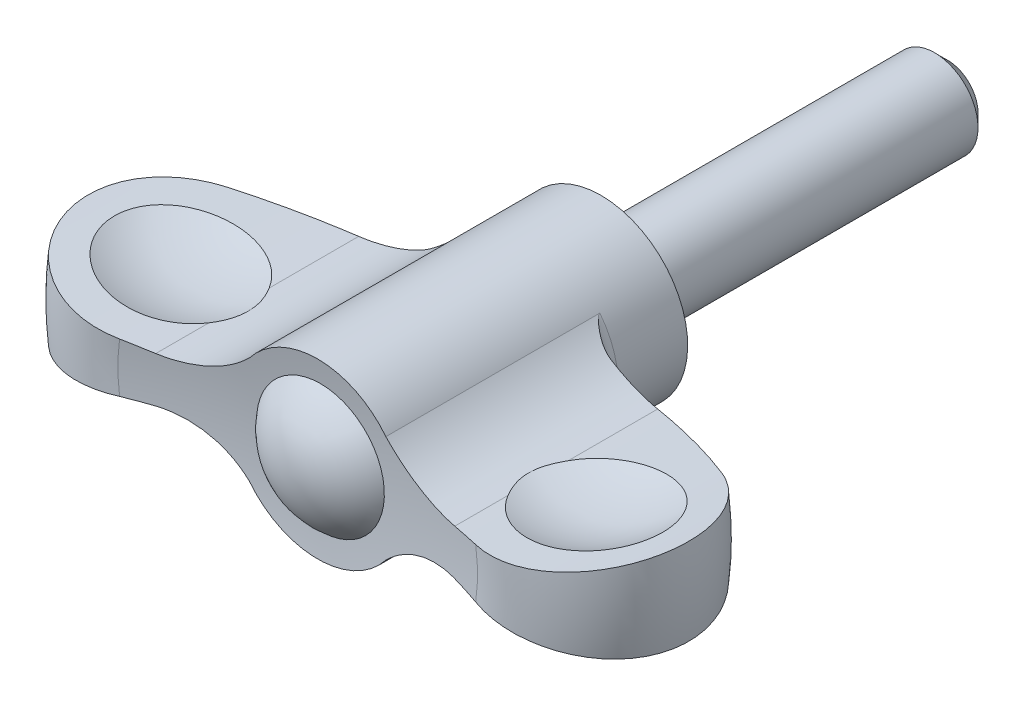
ISO-10303-21;
HEADER;
FILE_DESCRIPTION(('STEP AP214'),'2;1');
FILE_NAME('part.step','',(''),(''),'','','');
FILE_SCHEMA(('AUTOMOTIVE_DESIGN { 1 0 10303 214 1 1 1 1 }'));
ENDSEC;
DATA;
#1=APPLICATION_CONTEXT('core data for automotive mechanical design processes');
#2=APPLICATION_PROTOCOL_DEFINITION('international standard','automotive_design',2000,#1);
#3=PRODUCT_CONTEXT('',#1,'mechanical');
#4=PRODUCT('Part','Part','',(#3));
#5=PRODUCT_RELATED_PRODUCT_CATEGORY('part','',(#4));
#6=PRODUCT_DEFINITION_FORMATION('','',#4);
#7=PRODUCT_DEFINITION_CONTEXT('part definition',#1,'design');
#8=PRODUCT_DEFINITION('design','',#6,#7);
#9=PRODUCT_DEFINITION_SHAPE('','',#8);
#10=(LENGTH_UNIT() NAMED_UNIT(*) SI_UNIT(.MILLI.,.METRE.));
#11=(NAMED_UNIT(*) PLANE_ANGLE_UNIT() SI_UNIT($,.RADIAN.));
#12=(NAMED_UNIT(*) SI_UNIT($,.STERADIAN.) SOLID_ANGLE_UNIT());
#13=UNCERTAINTY_MEASURE_WITH_UNIT(LENGTH_MEASURE(1.E-05),#10,'distance_accuracy_value','');
#14=(GEOMETRIC_REPRESENTATION_CONTEXT(3) GLOBAL_UNCERTAINTY_ASSIGNED_CONTEXT((#13)) GLOBAL_UNIT_ASSIGNED_CONTEXT((#10,
#11,#12)) REPRESENTATION_CONTEXT('',''));
#15=CARTESIAN_POINT('',(0.,0.,0.));
#16=DIRECTION('',(0.,0.,1.));
#17=DIRECTION('',(1.,0.,0.));
#18=AXIS2_PLACEMENT_3D('',#15,#16,#17);
#19=CARTESIAN_POINT('',(0.,0.,8.));
#20=DIRECTION('',(0.,0.,-1.));
#21=DIRECTION('',(0.,1.,0.));
#22=AXIS2_PLACEMENT_3D('',#19,#20,#21);
#23=TOROIDAL_SURFACE('',#22,11.8,1.80000000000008);
#24=CARTESIAN_POINT('',(-10.936400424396,-3.94636818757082,9.7916319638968));
#25=CARTESIAN_POINT('',(-10.824118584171,-4.00370429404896,9.78325234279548));
#26=CARTESIAN_POINT('',(-10.7132133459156,-4.06254400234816,9.76897182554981));
#27=CARTESIAN_POINT('',(-10.4947965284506,-4.18269546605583,9.73031315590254));
#28=CARTESIAN_POINT('',(-10.3872790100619,-4.24400241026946,9.70595387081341));
#29=CARTESIAN_POINT('',(-10.1765147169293,-4.36838152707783,9.6489761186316));
#30=CARTESIAN_POINT('',(-10.0732455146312,-4.43144032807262,9.61641003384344));
#31=CARTESIAN_POINT('',(-9.87034998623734,-4.55941800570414,9.54423053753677));
#32=CARTESIAN_POINT('',(-9.77072514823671,-4.62433762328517,9.50461428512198));
#33=CARTESIAN_POINT('',(-9.55076497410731,-4.77218804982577,9.40879869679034));
#34=CARTESIAN_POINT('',(-9.43146470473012,-4.85557105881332,9.35092807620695));
#35=CARTESIAN_POINT('',(-9.19845422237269,-5.0245357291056,9.22749490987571));
#36=CARTESIAN_POINT('',(-9.08474708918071,-5.11011856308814,9.16192819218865));
#37=CARTESIAN_POINT('',(-8.89583509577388,-5.25740071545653,9.04459290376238));
#38=CARTESIAN_POINT('',(-8.81922141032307,-5.31864764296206,8.99450670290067));
#39=CARTESIAN_POINT('',(-8.66877804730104,-5.44185241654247,8.89113944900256));
#40=CARTESIAN_POINT('',(-8.59494804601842,-5.50381017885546,8.83785876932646));
#41=CARTESIAN_POINT('',(-8.4741799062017,-5.60755853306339,8.74594898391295));
#42=CARTESIAN_POINT('',(-8.42641392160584,-5.64925103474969,8.7082931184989));
#43=CARTESIAN_POINT('',(-8.33242521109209,-5.73256077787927,8.6310972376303));
#44=CARTESIAN_POINT('',(-8.28620142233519,-5.77417805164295,8.59155856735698));
#45=CARTESIAN_POINT('',(-8.21125367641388,-5.84266935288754,8.52388347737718));
#46=CARTESIAN_POINT('',(-8.18198002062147,-5.86968993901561,8.49650386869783));
#47=CARTESIAN_POINT('',(-8.12444979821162,-5.92330159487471,8.44010631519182));
#48=CARTESIAN_POINT('',(-8.09619524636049,-5.94989176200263,8.41108538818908));
#49=CARTESIAN_POINT('',(-8.04234032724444,-6.00103726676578,8.35179046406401));
#50=CARTESIAN_POINT('',(-8.01668026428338,-6.02563150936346,8.32160361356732));
#51=CARTESIAN_POINT('',(-7.96790958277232,-6.07276025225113,8.2576023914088));
#52=CARTESIAN_POINT('',(-7.94479257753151,-6.09529988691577,8.22379754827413));
#53=CARTESIAN_POINT('',(-7.91701322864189,-6.12255630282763,8.17250880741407));
#54=CARTESIAN_POINT('',(-7.90975258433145,-6.12970126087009,8.157793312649));
#55=CARTESIAN_POINT('',(-7.89665438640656,-6.14261741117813,8.12727584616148));
#56=CARTESIAN_POINT('',(-7.89080740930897,-6.14839769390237,8.11148202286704));
#57=CARTESIAN_POINT('',(-7.88158226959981,-6.15753000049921,8.08013275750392));
#58=CARTESIAN_POINT('',(-7.87802903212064,-6.16105398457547,8.06468423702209));
#59=CARTESIAN_POINT('',(-7.87307566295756,-6.16597001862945,8.03281428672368));
#60=CARTESIAN_POINT('',(-7.87172008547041,-6.16731795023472,8.01637956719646));
#61=CARTESIAN_POINT('',(-7.8717856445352,-6.16725149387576,7.9998));
#62=B_SPLINE_CURVE_WITH_KNOTS('',3,(#24,#25,#26,#27,#28,#29,#30,#31,#32,#33,#34,#35,#36,#37,#38,
#39,#40,#41,#42,#43,#44,#45,#46,#47,#48,#49,#50,#51,#52,#53,#54,#55,#56,#57,#58,#59,#60,#61),
.UNSPECIFIED.,.F.,.F.,(4,2,2,2,2,2,2,2,2,2,2,2,2,2,2,2,2,2,4),(0.,0.378686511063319,
0.756667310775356,1.13229407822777,1.50807255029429,1.97761636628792,2.44741590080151,
2.77774393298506,3.10803343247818,3.32923096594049,3.55027276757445,3.6952714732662,
3.84054267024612,3.98039395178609,4.11988557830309,4.17347981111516,4.22670627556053,
4.27513325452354,4.32453026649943),.UNSPECIFIED.);
#63=CARTESIAN_POINT('',(-10.9337221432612,-3.94773654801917,9.7914319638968));
#64=VERTEX_POINT('',#63);
#65=CARTESIAN_POINT('',(-7.8717855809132,-6.16725155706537,8.));
#66=VERTEX_POINT('',#65);
#67=EDGE_CURVE('E416',#64,#66,#62,.T.);
#68=ORIENTED_EDGE('',*,*,#67,.F.);
#69=CARTESIAN_POINT('',(0.,0.,9.7914319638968));
#70=DIRECTION('',(0.,0.,-1.));
#71=DIRECTION('',(0.,1.,0.));
#72=AXIS2_PLACEMENT_3D('',#69,#70,#71);
#73=CIRCLE('',#72,11.6245818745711);
#74=CARTESIAN_POINT('',(-10.9337221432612,3.94773654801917,9.7914319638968));
#75=VERTEX_POINT('',#74);
#76=EDGE_CURVE('E418',#64,#75,#73,.T.);
#77=ORIENTED_EDGE('',*,*,#76,.T.);
#78=CARTESIAN_POINT('',(-10.936400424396,3.94636818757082,9.7916319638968));
#79=CARTESIAN_POINT('',(-10.824118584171,4.00370429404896,9.78325234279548));
#80=CARTESIAN_POINT('',(-10.7132133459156,4.06254400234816,9.76897182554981));
#81=CARTESIAN_POINT('',(-10.4947965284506,4.18269546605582,9.73031315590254));
#82=CARTESIAN_POINT('',(-10.3872790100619,4.24400241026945,9.70595387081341));
#83=CARTESIAN_POINT('',(-10.1765147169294,4.36838152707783,9.64897611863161));
#84=CARTESIAN_POINT('',(-10.0732455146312,4.43144032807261,9.61641003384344));
#85=CARTESIAN_POINT('',(-9.87034998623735,4.55941800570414,9.54423053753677));
#86=CARTESIAN_POINT('',(-9.77072514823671,4.62433762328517,9.50461428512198));
#87=CARTESIAN_POINT('',(-9.55076497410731,4.77218804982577,9.40879869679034));
#88=CARTESIAN_POINT('',(-9.43146470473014,4.85557105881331,9.35092807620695));
#89=CARTESIAN_POINT('',(-9.1984542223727,5.02453572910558,9.22749490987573));
#90=CARTESIAN_POINT('',(-9.0847470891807,5.11011856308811,9.1619281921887));
#91=CARTESIAN_POINT('',(-8.89583509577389,5.25740071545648,9.04459290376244));
#92=CARTESIAN_POINT('',(-8.8192214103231,5.318647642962,8.99450670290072));
#93=CARTESIAN_POINT('',(-8.66877804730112,5.44185241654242,8.89113944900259));
#94=CARTESIAN_POINT('',(-8.59494804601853,5.50381017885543,8.8378587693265));
#95=CARTESIAN_POINT('',(-8.47417990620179,5.60755853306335,8.74594898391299));
#96=CARTESIAN_POINT('',(-8.4264139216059,5.64925103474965,8.70829311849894));
#97=CARTESIAN_POINT('',(-8.33242521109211,5.73256077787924,8.63109723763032));
#98=CARTESIAN_POINT('',(-8.2862014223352,5.77417805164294,8.59155856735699));
#99=CARTESIAN_POINT('',(-8.21125367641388,5.84266935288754,8.52388347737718));
#100=CARTESIAN_POINT('',(-8.18198002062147,5.86968993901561,8.49650386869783));
#101=CARTESIAN_POINT('',(-8.12444979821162,5.92330159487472,8.44010631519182));
#102=CARTESIAN_POINT('',(-8.09619524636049,5.94989176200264,8.41108538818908));
#103=CARTESIAN_POINT('',(-8.04234032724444,6.00103726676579,8.35179046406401));
#104=CARTESIAN_POINT('',(-8.01668026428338,6.02563150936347,8.32160361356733));
#105=CARTESIAN_POINT('',(-7.96790958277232,6.07276025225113,8.2576023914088));
#106=CARTESIAN_POINT('',(-7.94479257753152,6.09529988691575,8.22379754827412));
#107=CARTESIAN_POINT('',(-7.91701322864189,6.12255630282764,8.17250880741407));
#108=CARTESIAN_POINT('',(-7.90975258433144,6.1297012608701,8.15779331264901));
#109=CARTESIAN_POINT('',(-7.89665438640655,6.14261741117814,8.12727584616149));
#110=CARTESIAN_POINT('',(-7.89080740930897,6.14839769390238,8.11148202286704));
#111=CARTESIAN_POINT('',(-7.88158226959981,6.1575300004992,8.08013275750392));
#112=CARTESIAN_POINT('',(-7.87802903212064,6.16105398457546,8.06468423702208));
#113=CARTESIAN_POINT('',(-7.87307566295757,6.16597001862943,8.03281428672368));
#114=CARTESIAN_POINT('',(-7.87172008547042,6.16731795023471,8.01637956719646));
#115=CARTESIAN_POINT('',(-7.8717856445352,6.16725149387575,7.9998));
#116=B_SPLINE_CURVE_WITH_KNOTS('',3,(#78,#79,#80,#81,#82,#83,#84,#85,#86,#87,#88,#89,#90,#91,
#92,#93,#94,#95,#96,#97,#98,#99,#100,#101,#102,#103,#104,#105,#106,#107,#108,#109,#110,#111,
#112,#113,#114,#115),.UNSPECIFIED.,.F.,.F.,(4,2,2,2,2,2,2,2,2,2,2,2,2,2,2,2,2,2,4),(0.,
0.378686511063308,0.756667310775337,1.13229407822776,1.50807255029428,1.97761636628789,
2.44741590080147,2.77774393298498,3.10803343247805,3.32923096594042,3.55027276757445,
3.6952714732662,3.84054267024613,3.98039395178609,4.11988557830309,4.17347981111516,
4.22670627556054,4.27513325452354,4.32453026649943),.UNSPECIFIED.);
#117=CARTESIAN_POINT('',(-7.8717855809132,6.16725155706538,8.));
#118=VERTEX_POINT('',#117);
#119=EDGE_CURVE('E317',#75,#118,#116,.T.);
#120=ORIENTED_EDGE('',*,*,#119,.T.);
#121=CARTESIAN_POINT('',(0.,0.,8.));
#122=DIRECTION('',(0.,0.,-1.));
#123=DIRECTION('',(0.,1.,0.));
#124=AXIS2_PLACEMENT_3D('',#121,#122,#123);
#125=CIRCLE('',#124,10.);
#126=EDGE_CURVE('E420',#66,#118,#125,.T.);
#127=ORIENTED_EDGE('',*,*,#126,.F.);
#128=EDGE_LOOP('',(#68,#77,#120,#127));
#129=FACE_BOUND('',#128,.T.);
#130=ADVANCED_FACE('F14',(#129),#23,.F.);
#131=CARTESIAN_POINT('',(0.,0.,60.3122983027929));
#132=DIRECTION('',(0.,0.,-1.));
#133=DIRECTION('',(0.,1.,0.));
#134=AXIS2_PLACEMENT_3D('',#131,#132,#133);
#135=DEGENERATE_TOROIDAL_SURFACE('',#134,6.6775474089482,50.7624968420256,.T.);
#136=ORIENTED_EDGE('',*,*,#76,.F.);
#137=CARTESIAN_POINT('',(-6.5467060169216,-7.72330133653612,9.66697769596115));
#138=CARTESIAN_POINT('',(-6.64591288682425,-7.58492422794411,9.66416255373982));
#139=CARTESIAN_POINT('',(-6.74799440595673,-7.44862247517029,9.661900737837));
#140=CARTESIAN_POINT('',(-6.95774811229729,-7.18037757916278,9.65844214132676));
#141=CARTESIAN_POINT('',(-7.06542027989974,-7.04843442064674,9.6572453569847));
#142=CARTESIAN_POINT('',(-7.39653737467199,-6.6595102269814,9.65519040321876));
#143=CARTESIAN_POINT('',(-7.62812663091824,-6.40937348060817,9.65586643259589));
#144=CARTESIAN_POINT('',(-8.11129299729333,-5.92925394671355,9.66138002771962));
#145=CARTESIAN_POINT('',(-8.36287299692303,-5.69927408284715,9.66621819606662));
#146=CARTESIAN_POINT('',(-8.88421895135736,-5.26109545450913,9.68055080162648));
#147=CARTESIAN_POINT('',(-9.15398440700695,-5.05289609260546,9.69004511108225));
#148=CARTESIAN_POINT('',(-9.70731186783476,-4.66146851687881,9.71434109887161));
#149=CARTESIAN_POINT('',(-9.99073342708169,-4.47803881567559,9.72909588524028));
#150=CARTESIAN_POINT('',(-10.5714417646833,-4.13530031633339,9.76473262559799));
#151=CARTESIAN_POINT('',(-10.8687285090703,-3.97599145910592,9.78561456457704));
#152=CARTESIAN_POINT('',(-11.4746831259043,-3.68269992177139,9.83420440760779));
#153=CARTESIAN_POINT('',(-11.7833407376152,-3.54869504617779,9.86190627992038));
#154=CARTESIAN_POINT('',(-12.4099583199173,-3.30668939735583,9.92468529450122));
#155=CARTESIAN_POINT('',(-12.72791823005,-3.19868845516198,9.95976238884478));
#156=CARTESIAN_POINT('',(-13.3702784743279,-3.00943594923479,10.0375625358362));
#157=CARTESIAN_POINT('',(-13.694668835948,-2.92814595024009,10.080274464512));
#158=CARTESIAN_POINT('',(-14.3479208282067,-2.7924555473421,10.173495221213));
#159=CARTESIAN_POINT('',(-14.6767824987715,-2.73805538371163,10.2240041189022));
#160=CARTESIAN_POINT('',(-15.3369192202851,-2.65620760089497,10.3328061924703));
#161=CARTESIAN_POINT('',(-15.6681964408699,-2.62878831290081,10.3911074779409));
#162=CARTESIAN_POINT('',(-16.3304789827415,-2.60086726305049,10.5152293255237));
#163=CARTESIAN_POINT('',(-16.6614842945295,-2.60036640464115,10.5810501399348));
#164=CARTESIAN_POINT('',(-17.3240428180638,-2.62605289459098,10.7205107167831));
#165=CARTESIAN_POINT('',(-17.6555720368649,-2.65249066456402,10.7942180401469));
#166=CARTESIAN_POINT('',(-18.3138495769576,-2.73187573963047,10.9484805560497));
#167=CARTESIAN_POINT('',(-18.6405974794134,-2.78482535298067,11.0290363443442));
#168=CARTESIAN_POINT('',(-19.2867879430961,-2.91642655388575,11.1963521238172));
#169=CARTESIAN_POINT('',(-19.6062391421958,-2.99504586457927,11.2831042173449));
#170=CARTESIAN_POINT('',(-20.2362844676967,-3.17708996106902,11.4622866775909));
#171=CARTESIAN_POINT('',(-20.5468805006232,-3.28050936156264,11.5547158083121));
#172=CARTESIAN_POINT('',(-20.8521318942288,-3.39588894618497,11.6496949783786));
#173=B_SPLINE_CURVE_WITH_KNOTS('',3,(#137,#138,#139,#140,#141,#142,#143,#144,#145,#146,#147,
#148,#149,#150,#151,#152,#153,#154,#155,#156,#157,#158,#159,#160,#161,#162,#163,#164,#165,#166,
#167,#168,#169,#170,#171,#172),.UNSPECIFIED.,.F.,.F.,(4,2,2,2,2,2,2,2,2,2,2,2,2,2,2,2,2,4),(0.,
0.510785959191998,1.02157012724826,2.04291399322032,3.06440575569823,4.08586949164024,
5.09844663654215,6.11102130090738,7.12270361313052,8.13437935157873,9.14459291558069,
10.1548155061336,11.1660977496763,12.1774139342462,13.1982178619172,14.2191106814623,
15.2387247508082,16.2581176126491),.UNSPECIFIED.);
#174=CARTESIAN_POINT('',(-17.2513916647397,-2.62600423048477,10.7060191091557));
#175=VERTEX_POINT('',#174);
#176=EDGE_CURVE('E424',#64,#175,#173,.T.);
#177=ORIENTED_EDGE('',*,*,#176,.T.);
#178=CARTESIAN_POINT('',(-28.5420587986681,-3.86093353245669,14.6248916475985));
#179=CARTESIAN_POINT('',(-28.0949251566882,-3.78973654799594,14.4056959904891));
#180=CARTESIAN_POINT('',(-27.6441940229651,-3.72065339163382,14.1932196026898));
#181=CARTESIAN_POINT('',(-26.7359054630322,-3.58698745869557,13.7818878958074));
#182=CARTESIAN_POINT('',(-26.2783480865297,-3.52240464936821,13.583032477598));
#183=CARTESIAN_POINT('',(-24.8998297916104,-3.33633398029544,13.0087706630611));
#184=CARTESIAN_POINT('',(-23.9692804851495,-3.22192463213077,12.6538347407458));
#185=CARTESIAN_POINT('',(-22.0863023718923,-3.01405683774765,12.0002442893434));
#186=CARTESIAN_POINT('',(-21.133873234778,-2.92059870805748,11.701590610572));
#187=CARTESIAN_POINT('',(-19.6898454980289,-2.79722984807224,11.296179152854));
#188=CARTESIAN_POINT('',(-19.2049108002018,-2.75884755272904,11.1679139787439));
#189=CARTESIAN_POINT('',(-18.2309836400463,-2.68796520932,10.9259763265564));
#190=CARTESIAN_POINT('',(-17.7419911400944,-2.65546521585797,10.8123039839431));
#191=CARTESIAN_POINT('',(-17.2511916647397,-2.6259922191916,10.7059757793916));
#192=B_SPLINE_CURVE_WITH_KNOTS('',3,(#178,#179,#180,#181,#182,#183,#184,#185,#186,#187,#188,
#189,#190,#191),.UNSPECIFIED.,.F.,.F.,(4,2,2,2,2,2,4),(0.,1.50898291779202,3.01795485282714,
6.0232908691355,9.02867228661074,10.5376740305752,12.0466897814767),.UNSPECIFIED.);
#193=CARTESIAN_POINT('',(-28.5416508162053,-3.86086857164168,14.6246916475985));
#194=VERTEX_POINT('',#193);
#195=EDGE_CURVE('E506',#194,#175,#192,.T.);
#196=ORIENTED_EDGE('',*,*,#195,.F.);
#197=CARTESIAN_POINT('',(0.,0.,14.6246916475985));
#198=DIRECTION('',(0.,0.,-1.));
#199=DIRECTION('',(0.,1.,0.));
#200=AXIS2_PLACEMENT_3D('',#197,#198,#199);
#201=CIRCLE('',#200,28.8015995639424);
#202=CARTESIAN_POINT('',(-28.5416508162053,3.86086857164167,14.6246916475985));
#203=VERTEX_POINT('',#202);
#204=EDGE_CURVE('E434',#194,#203,#201,.T.);
#205=ORIENTED_EDGE('',*,*,#204,.T.);
#206=CARTESIAN_POINT('',(-28.542058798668,3.86093353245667,14.6248916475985));
#207=CARTESIAN_POINT('',(-28.0949251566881,3.78973654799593,14.4056959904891));
#208=CARTESIAN_POINT('',(-27.644194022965,3.7206533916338,14.1932196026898));
#209=CARTESIAN_POINT('',(-26.7359054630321,3.58698745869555,13.7818878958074));
#210=CARTESIAN_POINT('',(-26.2783480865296,3.52240464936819,13.583032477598));
#211=CARTESIAN_POINT('',(-24.8998297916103,3.33633398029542,13.0087706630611));
#212=CARTESIAN_POINT('',(-23.9692804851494,3.22192463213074,12.6538347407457));
#213=CARTESIAN_POINT('',(-22.0863023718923,3.01405683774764,12.0002442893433));
#214=CARTESIAN_POINT('',(-21.133873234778,2.92059870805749,11.701590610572));
#215=CARTESIAN_POINT('',(-19.6898454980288,2.79722984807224,11.296179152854));
#216=CARTESIAN_POINT('',(-19.2049108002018,2.75884755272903,11.1679139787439));
#217=CARTESIAN_POINT('',(-18.2309836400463,2.68796520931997,10.9259763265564));
#218=CARTESIAN_POINT('',(-17.7419911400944,2.65546521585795,10.8123039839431));
#219=CARTESIAN_POINT('',(-17.2511916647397,2.6259922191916,10.7059757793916));
#220=B_SPLINE_CURVE_WITH_KNOTS('',3,(#206,#207,#208,#209,#210,#211,#212,#213,#214,#215,#216,
#217,#218,#219),.UNSPECIFIED.,.F.,.F.,(4,2,2,2,2,2,4),(0.,1.50898291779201,3.01795485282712,
6.02329086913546,9.02867228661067,10.5376740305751,12.0466897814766),.UNSPECIFIED.);
#221=CARTESIAN_POINT('',(-17.2513916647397,2.62600423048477,10.7060191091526));
#222=VERTEX_POINT('',#221);
#223=EDGE_CURVE('E331',#203,#222,#220,.T.);
#224=ORIENTED_EDGE('',*,*,#223,.T.);
#225=CARTESIAN_POINT('',(-6.5467060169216,7.72330133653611,9.66697769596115));
#226=CARTESIAN_POINT('',(-6.64591288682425,7.5849242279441,9.66416255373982));
#227=CARTESIAN_POINT('',(-6.74799440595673,7.44862247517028,9.661900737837));
#228=CARTESIAN_POINT('',(-6.9577481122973,7.18037757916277,9.65844214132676));
#229=CARTESIAN_POINT('',(-7.06542027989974,7.04843442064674,9.6572453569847));
#230=CARTESIAN_POINT('',(-7.39653737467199,6.65951022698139,9.65519040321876));
#231=CARTESIAN_POINT('',(-7.62812663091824,6.40937348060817,9.65586643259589));
#232=CARTESIAN_POINT('',(-8.11129299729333,5.92925394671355,9.66138002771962));
#233=CARTESIAN_POINT('',(-8.36287299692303,5.69927408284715,9.66621819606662));
#234=CARTESIAN_POINT('',(-8.88421895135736,5.26109545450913,9.68055080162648));
#235=CARTESIAN_POINT('',(-9.15398440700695,5.05289609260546,9.69004511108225));
#236=CARTESIAN_POINT('',(-9.70731186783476,4.66146851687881,9.71434109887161));
#237=CARTESIAN_POINT('',(-9.99073342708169,4.47803881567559,9.72909588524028));
#238=CARTESIAN_POINT('',(-10.5714417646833,4.13530031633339,9.76473262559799));
#239=CARTESIAN_POINT('',(-10.8687285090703,3.97599145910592,9.78561456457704));
#240=CARTESIAN_POINT('',(-11.4746831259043,3.68269992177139,9.83420440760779));
#241=CARTESIAN_POINT('',(-11.7833407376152,3.54869504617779,9.86190627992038));
#242=CARTESIAN_POINT('',(-12.4099583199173,3.30668939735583,9.92468529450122));
#243=CARTESIAN_POINT('',(-12.72791823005,3.19868845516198,9.95976238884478));
#244=CARTESIAN_POINT('',(-13.3702784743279,3.00943594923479,10.0375625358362));
#245=CARTESIAN_POINT('',(-13.694668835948,2.92814595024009,10.080274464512));
#246=CARTESIAN_POINT('',(-14.3479208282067,2.7924555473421,10.173495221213));
#247=CARTESIAN_POINT('',(-14.6767824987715,2.73805538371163,10.2240041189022));
#248=CARTESIAN_POINT('',(-15.3369192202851,2.65620760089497,10.3328061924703));
#249=CARTESIAN_POINT('',(-15.6681964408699,2.62878831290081,10.3911074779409));
#250=CARTESIAN_POINT('',(-16.3304789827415,2.60086726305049,10.5152293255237));
#251=CARTESIAN_POINT('',(-16.6614842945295,2.60036640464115,10.5810501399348));
#252=CARTESIAN_POINT('',(-17.3240428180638,2.62605289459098,10.7205107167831));
#253=CARTESIAN_POINT('',(-17.6555720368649,2.65249066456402,10.7942180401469));
#254=CARTESIAN_POINT('',(-18.3138495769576,2.73187573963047,10.9484805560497));
#255=CARTESIAN_POINT('',(-18.6405974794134,2.78482535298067,11.0290363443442));
#256=CARTESIAN_POINT('',(-19.2867879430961,2.91642655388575,11.1963521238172));
#257=CARTESIAN_POINT('',(-19.6062391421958,2.99504586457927,11.2831042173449));
#258=CARTESIAN_POINT('',(-20.2362844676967,3.17708996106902,11.4622866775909));
#259=CARTESIAN_POINT('',(-20.5468805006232,3.28050936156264,11.5547158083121));
#260=CARTESIAN_POINT('',(-20.8521318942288,3.39588894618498,11.6496949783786));
#261=B_SPLINE_CURVE_WITH_KNOTS('',3,(#225,#226,#227,#228,#229,#230,#231,#232,#233,#234,#235,
#236,#237,#238,#239,#240,#241,#242,#243,#244,#245,#246,#247,#248,#249,#250,#251,#252,#253,#254,
#255,#256,#257,#258,#259,#260),.UNSPECIFIED.,.F.,.F.,(4,2,2,2,2,2,2,2,2,2,2,2,2,2,2,2,2,4),(0.,
0.510785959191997,1.02157012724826,2.04291399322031,3.06440575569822,4.08586949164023,
5.09844663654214,6.11102130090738,7.12270361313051,8.13437935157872,9.14459291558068,
10.1548155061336,11.1660977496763,12.1774139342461,13.1982178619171,14.2191106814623,
15.2387247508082,16.2581176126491),.UNSPECIFIED.);
#262=EDGE_CURVE('E300',#75,#222,#261,.T.);
#263=ORIENTED_EDGE('',*,*,#262,.F.);
#264=EDGE_LOOP('',(#136,#177,#196,#205,#224,#263));
#265=FACE_BOUND('',#264,.T.);
#266=ADVANCED_FACE('F406',(#265),#135,.T.);
#267=CARTESIAN_POINT('',(0.,0.,24.5131504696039));
#268=DIRECTION('',(0.,0.,-1.));
#269=DIRECTION('',(0.,1.,0.));
#270=AXIS2_PLACEMENT_3D('',#267,#268,#269);
#271=TOROIDAL_SURFACE('',#270,24.0131504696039,10.9868495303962);
#272=CARTESIAN_POINT('',(-17.2511916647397,-2.62599221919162,33.3242100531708));
#273=CARTESIAN_POINT('',(-17.4993781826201,-2.64089075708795,33.5086851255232));
#274=CARTESIAN_POINT('',(-17.7552628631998,-2.65706460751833,33.6826969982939));
#275=CARTESIAN_POINT('',(-18.28053769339,-2.69210530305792,34.0086627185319));
#276=CARTESIAN_POINT('',(-18.5499277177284,-2.71097212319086,34.1606167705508));
#277=CARTESIAN_POINT('',(-19.1002002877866,-2.75153205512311,34.4412740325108));
#278=CARTESIAN_POINT('',(-19.381077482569,-2.77322386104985,34.5699879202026));
#279=CARTESIAN_POINT('',(-19.952432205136,-2.81952002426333,34.8033129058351));
#280=CARTESIAN_POINT('',(-20.2429095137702,-2.84412431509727,34.9079245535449));
#281=CARTESIAN_POINT('',(-20.8315983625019,-2.89628797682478,35.0923323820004));
#282=CARTESIAN_POINT('',(-21.1298150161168,-2.92384934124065,35.1721116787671));
#283=CARTESIAN_POINT('',(-21.7316508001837,-2.98187199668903,35.3061577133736));
#284=CARTESIAN_POINT('',(-22.035269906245,-3.01233327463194,35.3604245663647));
#285=CARTESIAN_POINT('',(-22.6456357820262,-3.0760359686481,35.4430189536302));
#286=CARTESIAN_POINT('',(-22.9523815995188,-3.10927655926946,35.4713541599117));
#287=CARTESIAN_POINT('',(-23.566877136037,-3.17836345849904,35.501889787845));
#288=CARTESIAN_POINT('',(-23.874626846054,-3.21420974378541,35.504090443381));
#289=CARTESIAN_POINT('',(-24.4874432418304,-3.28807700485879,35.4823817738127));
#290=CARTESIAN_POINT('',(-24.7925157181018,-3.32608674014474,35.4585974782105));
#291=CARTESIAN_POINT('',(-25.3992908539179,-3.404117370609,35.3852808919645));
#292=CARTESIAN_POINT('',(-25.7009935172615,-3.44413826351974,35.3357486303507));
#293=CARTESIAN_POINT('',(-26.2989412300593,-3.52581537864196,35.211278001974));
#294=CARTESIAN_POINT('',(-26.595185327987,-3.56747188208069,35.1363352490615));
#295=CARTESIAN_POINT('',(-27.1800717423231,-3.65197221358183,34.9615826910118));
#296=CARTESIAN_POINT('',(-27.4687140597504,-3.69481604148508,34.8617728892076));
#297=CARTESIAN_POINT('',(-28.035952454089,-3.78113479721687,34.6381665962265));
#298=CARTESIAN_POINT('',(-28.3145627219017,-3.82460870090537,34.514405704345));
#299=CARTESIAN_POINT('',(-28.8602471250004,-3.9117173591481,34.2436848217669));
#300=CARTESIAN_POINT('',(-29.1273212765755,-3.9553521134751,34.0967248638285));
#301=CARTESIAN_POINT('',(-29.6480727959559,-4.04221651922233,33.7806574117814));
#302=CARTESIAN_POINT('',(-29.9017509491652,-4.08544619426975,33.6115512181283));
#303=CARTESIAN_POINT('',(-30.3939845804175,-4.17091924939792,33.2523788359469));
#304=CARTESIAN_POINT('',(-30.6325400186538,-4.21316262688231,33.0623125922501));
#305=CARTESIAN_POINT('',(-31.0935716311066,-4.29619199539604,32.6619711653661));
#306=CARTESIAN_POINT('',(-31.3159985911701,-4.33697334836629,32.4516383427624));
#307=CARTESIAN_POINT('',(-31.7424740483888,-4.41635307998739,32.0127202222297));
#308=CARTESIAN_POINT('',(-31.9465225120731,-4.45495145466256,31.7841348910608));
#309=CARTESIAN_POINT('',(-32.3348520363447,-4.5293877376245,31.3103146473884));
#310=CARTESIAN_POINT('',(-32.5191323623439,-4.56522554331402,31.0650791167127));
#311=CARTESIAN_POINT('',(-32.8666572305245,-4.63358841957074,30.5596945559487));
#312=CARTESIAN_POINT('',(-33.0299017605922,-4.66611348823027,30.2995455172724));
#313=CARTESIAN_POINT('',(-33.3345075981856,-4.72739462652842,29.7656976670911));
#314=CARTESIAN_POINT('',(-33.4758297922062,-4.75614394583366,29.4919757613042));
#315=CARTESIAN_POINT('',(-33.7352733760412,-4.80934524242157,28.9333467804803));
#316=CARTESIAN_POINT('',(-33.8533947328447,-4.83379721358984,28.6484396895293));
#317=CARTESIAN_POINT('',(-34.0656204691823,-4.87800530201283,28.0694731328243));
#318=CARTESIAN_POINT('',(-34.1597255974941,-4.89776156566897,27.7754139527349));
#319=CARTESIAN_POINT('',(-34.3232748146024,-4.93225390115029,27.180228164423));
#320=CARTESIAN_POINT('',(-34.3927189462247,-4.94698998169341,26.8791015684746));
#321=CARTESIAN_POINT('',(-34.5063857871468,-4.97117989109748,26.2723608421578));
#322=CARTESIAN_POINT('',(-34.5506442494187,-4.98064120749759,25.96675370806));
#323=CARTESIAN_POINT('',(-34.6137870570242,-4.99415603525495,25.3528106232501));
#324=CARTESIAN_POINT('',(-34.6326714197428,-4.99820955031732,25.0444746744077));
#325=CARTESIAN_POINT('',(-34.644935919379,-5.00084099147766,24.4272603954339));
#326=CARTESIAN_POINT('',(-34.6383150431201,-4.99941870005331,24.1183820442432));
#327=CARTESIAN_POINT('',(-34.5996125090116,-4.9911218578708,23.5022985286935));
#328=CARTESIAN_POINT('',(-34.5675308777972,-4.9842473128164,23.1950933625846));
#329=CARTESIAN_POINT('',(-34.4781950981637,-4.96517513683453,22.5850017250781));
#330=CARTESIAN_POINT('',(-34.4209785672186,-4.95298546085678,22.2821094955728));
#331=CARTESIAN_POINT('',(-34.2817747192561,-4.92348679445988,21.6823260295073));
#332=CARTESIAN_POINT('',(-34.1997873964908,-4.90617780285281,21.3854347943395));
#333=CARTESIAN_POINT('',(-34.0116119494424,-4.86672680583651,20.799780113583));
#334=CARTESIAN_POINT('',(-33.9054257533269,-4.84458518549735,20.5110160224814));
#335=CARTESIAN_POINT('',(-33.6695763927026,-4.79582854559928,19.9436331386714));
#336=CARTESIAN_POINT('',(-33.5399133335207,-4.76921354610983,19.6650143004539));
#337=CARTESIAN_POINT('',(-33.2578321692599,-4.71190410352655,19.1195687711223));
#338=CARTESIAN_POINT('',(-33.1053878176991,-4.68120495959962,18.8527561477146));
#339=CARTESIAN_POINT('',(-32.7788934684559,-4.61623623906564,18.3331441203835));
#340=CARTESIAN_POINT('',(-32.6048429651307,-4.58196657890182,18.0803450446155));
#341=CARTESIAN_POINT('',(-32.2363296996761,-4.51038975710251,17.5905487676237));
#342=CARTESIAN_POINT('',(-32.0418667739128,-4.47308257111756,17.3535516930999));
#343=CARTESIAN_POINT('',(-31.633867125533,-4.39599896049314,16.8970435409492));
#344=CARTESIAN_POINT('',(-31.4203320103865,-4.35622274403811,16.6775309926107));
#345=CARTESIAN_POINT('',(-31.0011481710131,-4.27945832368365,16.2816097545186));
#346=CARTESIAN_POINT('',(-30.797399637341,-4.24267293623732,16.103144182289));
#347=CARTESIAN_POINT('',(-30.377205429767,-4.16804353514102,15.7621159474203));
#348=CARTESIAN_POINT('',(-30.1607608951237,-4.13019961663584,15.5995518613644));
#349=CARTESIAN_POINT('',(-29.7163820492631,-4.05387450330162,15.2912603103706));
#350=CARTESIAN_POINT('',(-29.4884504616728,-4.01539346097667,15.1455288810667));
#351=CARTESIAN_POINT('',(-29.0222683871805,-3.9381829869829,14.871631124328));
#352=CARTESIAN_POINT('',(-28.7840165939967,-3.89945352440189,14.7434670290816));
#353=CARTESIAN_POINT('',(-28.5412428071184,-3.86080360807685,14.6244916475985));
#354=B_SPLINE_CURVE_WITH_KNOTS('',3,(#272,#273,#274,#275,#276,#277,#278,#279,#280,#281,#282,
#283,#284,#285,#286,#287,#288,#289,#290,#291,#292,#293,#294,#295,#296,#297,#298,#299,#300,#301,
#302,#303,#304,#305,#306,#307,#308,#309,#310,#311,#312,#313,#314,#315,#316,#317,#318,#319,#320,
#321,#322,#323,#324,#325,#326,#327,#328,#329,#330,#331,#332,#333,#334,#335,#336,#337,#338,#339,
#340,#341,#342,#343,#344,#345,#346,#347,#348,#349,#350,#351,#352,#353),.UNSPECIFIED.,.F.,.F.,(4,
2,2,2,2,2,2,2,2,2,2,2,2,2,2,2,2,2,2,2,2,2,2,2,2,2,2,2,2,2,2,2,2,2,2,2,2,2,2,2,4),(0.,
0.928513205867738,1.85701780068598,2.7850947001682,3.7131504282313,4.64183578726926,
5.57051695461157,6.49892327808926,7.42732129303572,8.35127181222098,9.27522128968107,
10.1993303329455,11.1234392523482,12.0461850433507,12.9689295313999,13.8916198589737,
14.8143126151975,15.7397117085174,16.6651124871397,17.5905476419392,18.5159833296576,
19.4430516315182,20.3701212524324,21.2971619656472,22.2242010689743,23.1499208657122,
24.0756400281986,25.0013959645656,25.9271509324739,26.8515250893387,27.7758994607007,
28.7002002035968,29.6244967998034,30.5498666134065,31.4752580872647,32.4006569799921,
33.3259779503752,34.1452666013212,34.9644818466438,35.7835037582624,36.6026296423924),.UNSPECIFIED.);
#355=CARTESIAN_POINT('',(-20.5453214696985,-2.87092129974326,35.0026521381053));
#356=VERTEX_POINT('',#355);
#357=EDGE_CURVE('E497',#356,#194,#354,.T.);
#358=ORIENTED_EDGE('',*,*,#357,.F.);
#359=CARTESIAN_POINT('',(0.,0.,35.0026521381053));
#360=DIRECTION('',(0.,0.,-1.));
#361=DIRECTION('',(0.,1.,0.));
#362=AXIS2_PLACEMENT_3D('',#359,#360,#361);
#363=CIRCLE('',#362,20.7449372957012);
#364=CARTESIAN_POINT('',(-20.5453214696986,2.87092129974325,35.0026521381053));
#365=VERTEX_POINT('',#364);
#366=EDGE_CURVE('E487',#356,#365,#363,.T.);
#367=ORIENTED_EDGE('',*,*,#366,.T.);
#368=CARTESIAN_POINT('',(-17.2511916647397,2.6259922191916,33.3242100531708));
#369=CARTESIAN_POINT('',(-17.4993781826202,2.64089075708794,33.5086851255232));
#370=CARTESIAN_POINT('',(-17.7552628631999,2.65706460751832,33.6826969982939));
#371=CARTESIAN_POINT('',(-18.28053769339,2.69210530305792,34.0086627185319));
#372=CARTESIAN_POINT('',(-18.5499277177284,2.71097212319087,34.1606167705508));
#373=CARTESIAN_POINT('',(-19.1002002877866,2.75153205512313,34.4412740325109));
#374=CARTESIAN_POINT('',(-19.3810774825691,2.77322386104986,34.5699879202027));
#375=CARTESIAN_POINT('',(-19.952432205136,2.81952002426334,34.8033129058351));
#376=CARTESIAN_POINT('',(-20.2429095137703,2.84412431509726,34.9079245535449));
#377=CARTESIAN_POINT('',(-20.831598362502,2.89628797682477,35.0923323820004));
#378=CARTESIAN_POINT('',(-21.1298150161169,2.92384934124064,35.1721116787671));
#379=CARTESIAN_POINT('',(-21.7316508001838,2.98187199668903,35.3061577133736));
#380=CARTESIAN_POINT('',(-22.0352699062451,3.01233327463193,35.3604245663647));
#381=CARTESIAN_POINT('',(-22.6456357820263,3.0760359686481,35.4430189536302));
#382=CARTESIAN_POINT('',(-22.9523815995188,3.10927655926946,35.4713541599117));
#383=CARTESIAN_POINT('',(-23.566877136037,3.17836345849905,35.501889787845));
#384=CARTESIAN_POINT('',(-23.874626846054,3.21420974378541,35.504090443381));
#385=CARTESIAN_POINT('',(-24.4874432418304,3.28807700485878,35.4823817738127));
#386=CARTESIAN_POINT('',(-24.7925157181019,3.32608674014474,35.4585974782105));
#387=CARTESIAN_POINT('',(-25.3992908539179,3.404117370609,35.3852808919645));
#388=CARTESIAN_POINT('',(-25.7009935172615,3.44413826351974,35.3357486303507));
#389=CARTESIAN_POINT('',(-26.2989412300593,3.52581537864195,35.211278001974));
#390=CARTESIAN_POINT('',(-26.595185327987,3.56747188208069,35.1363352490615));
#391=CARTESIAN_POINT('',(-27.1800717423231,3.65197221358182,34.9615826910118));
#392=CARTESIAN_POINT('',(-27.4687140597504,3.69481604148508,34.8617728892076));
#393=CARTESIAN_POINT('',(-28.035952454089,3.78113479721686,34.6381665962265));
#394=CARTESIAN_POINT('',(-28.3145627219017,3.82460870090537,34.514405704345));
#395=CARTESIAN_POINT('',(-28.8602471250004,3.9117173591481,34.2436848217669));
#396=CARTESIAN_POINT('',(-29.1273212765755,3.9553521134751,34.0967248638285));
#397=CARTESIAN_POINT('',(-29.6480727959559,4.04221651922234,33.7806574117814));
#398=CARTESIAN_POINT('',(-29.9017509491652,4.08544619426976,33.6115512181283));
#399=CARTESIAN_POINT('',(-30.3939845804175,4.17091924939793,33.2523788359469));
#400=CARTESIAN_POINT('',(-30.6325400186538,4.21316262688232,33.0623125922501));
#401=CARTESIAN_POINT('',(-31.0935716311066,4.29619199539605,32.6619711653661));
#402=CARTESIAN_POINT('',(-31.3159985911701,4.33697334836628,32.4516383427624));
#403=CARTESIAN_POINT('',(-31.7424740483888,4.41635307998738,32.0127202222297));
#404=CARTESIAN_POINT('',(-31.9465225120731,4.45495145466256,31.7841348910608));
#405=CARTESIAN_POINT('',(-32.3348520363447,4.52938773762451,31.3103146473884));
#406=CARTESIAN_POINT('',(-32.5191323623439,4.56522554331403,31.0650791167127));
#407=CARTESIAN_POINT('',(-32.8666572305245,4.63358841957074,30.5596945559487));
#408=CARTESIAN_POINT('',(-33.0299017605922,4.66611348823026,30.2995455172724));
#409=CARTESIAN_POINT('',(-33.3345075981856,4.72739462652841,29.7656976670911));
#410=CARTESIAN_POINT('',(-33.4758297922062,4.75614394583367,29.4919757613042));
#411=CARTESIAN_POINT('',(-33.7352733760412,4.80934524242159,28.9333467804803));
#412=CARTESIAN_POINT('',(-33.8533947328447,4.83379721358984,28.6484396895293));
#413=CARTESIAN_POINT('',(-34.0656204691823,4.87800530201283,28.0694731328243));
#414=CARTESIAN_POINT('',(-34.1597255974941,4.89776156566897,27.7754139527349));
#415=CARTESIAN_POINT('',(-34.3232748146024,4.93225390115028,27.180228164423));
#416=CARTESIAN_POINT('',(-34.3927189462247,4.9469899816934,26.8791015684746));
#417=CARTESIAN_POINT('',(-34.5063857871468,4.97117989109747,26.2723608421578));
#418=CARTESIAN_POINT('',(-34.5506442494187,4.9806412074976,25.96675370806));
#419=CARTESIAN_POINT('',(-34.6137870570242,4.99415603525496,25.3528106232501));
#420=CARTESIAN_POINT('',(-34.6326714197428,4.99820955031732,25.0444746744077));
#421=CARTESIAN_POINT('',(-34.644935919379,5.00084099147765,24.4272603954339));
#422=CARTESIAN_POINT('',(-34.6383150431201,4.9994187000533,24.1183820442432));
#423=CARTESIAN_POINT('',(-34.5996125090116,4.99112185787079,23.5022985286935));
#424=CARTESIAN_POINT('',(-34.5675308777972,4.98424731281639,23.1950933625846));
#425=CARTESIAN_POINT('',(-34.4781950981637,4.96517513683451,22.5850017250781));
#426=CARTESIAN_POINT('',(-34.4209785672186,4.95298546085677,22.2821094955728));
#427=CARTESIAN_POINT('',(-34.2817747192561,4.92348679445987,21.6823260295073));
#428=CARTESIAN_POINT('',(-34.1997873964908,4.90617780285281,21.3854347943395));
#429=CARTESIAN_POINT('',(-34.0116119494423,4.86672680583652,20.7997801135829));
#430=CARTESIAN_POINT('',(-33.9054257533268,4.84458518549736,20.5110160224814));
#431=CARTESIAN_POINT('',(-33.6695763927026,4.79582854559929,19.9436331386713));
#432=CARTESIAN_POINT('',(-33.5399133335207,4.76921354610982,19.6650143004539));
#433=CARTESIAN_POINT('',(-33.2578321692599,4.71190410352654,19.1195687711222));
#434=CARTESIAN_POINT('',(-33.1053878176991,4.68120495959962,18.8527561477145));
#435=CARTESIAN_POINT('',(-32.7788934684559,4.61623623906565,18.3331441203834));
#436=CARTESIAN_POINT('',(-32.6048429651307,4.58196657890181,18.0803450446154));
#437=CARTESIAN_POINT('',(-32.2363296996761,4.5103897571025,17.5905487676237));
#438=CARTESIAN_POINT('',(-32.0418667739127,4.47308257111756,17.3535516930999));
#439=CARTESIAN_POINT('',(-31.633867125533,4.39599896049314,16.8970435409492));
#440=CARTESIAN_POINT('',(-31.4203320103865,4.3562227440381,16.6775309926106));
#441=CARTESIAN_POINT('',(-31.0011481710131,4.27945832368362,16.2816097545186));
#442=CARTESIAN_POINT('',(-30.797399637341,4.2426729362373,16.103144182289));
#443=CARTESIAN_POINT('',(-30.377205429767,4.16804353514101,15.7621159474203));
#444=CARTESIAN_POINT('',(-30.1607608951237,4.13019961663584,15.5995518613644));
#445=CARTESIAN_POINT('',(-29.7163820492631,4.05387450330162,15.2912603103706));
#446=CARTESIAN_POINT('',(-29.4884504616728,4.01539346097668,15.1455288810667));
#447=CARTESIAN_POINT('',(-29.0222683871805,3.93818298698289,14.871631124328));
#448=CARTESIAN_POINT('',(-28.7840165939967,3.89945352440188,14.7434670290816));
#449=CARTESIAN_POINT('',(-28.5412428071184,3.86080360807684,14.6244916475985));
#450=B_SPLINE_CURVE_WITH_KNOTS('',3,(#368,#369,#370,#371,#372,#373,#374,#375,#376,#377,#378,
#379,#380,#381,#382,#383,#384,#385,#386,#387,#388,#389,#390,#391,#392,#393,#394,#395,#396,#397,
#398,#399,#400,#401,#402,#403,#404,#405,#406,#407,#408,#409,#410,#411,#412,#413,#414,#415,#416,
#417,#418,#419,#420,#421,#422,#423,#424,#425,#426,#427,#428,#429,#430,#431,#432,#433,#434,#435,
#436,#437,#438,#439,#440,#441,#442,#443,#444,#445,#446,#447,#448,#449),.UNSPECIFIED.,.F.,.F.,(4,
2,2,2,2,2,2,2,2,2,2,2,2,2,2,2,2,2,2,2,2,2,2,2,2,2,2,2,2,2,2,2,2,2,2,2,2,2,2,2,4),(0.,
0.92851320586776,1.85701780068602,2.78509470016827,3.7131504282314,4.64183578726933,
5.57051695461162,6.49892327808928,7.42732129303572,8.35127181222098,9.27522128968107,
10.1993303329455,11.1234392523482,12.0461850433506,12.9689295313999,13.8916198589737,
14.8143126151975,15.7397117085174,16.6651124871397,17.5905476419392,18.5159833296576,
19.4430516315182,20.3701212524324,21.2971619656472,22.2242010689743,23.1499208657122,
24.0756400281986,25.0013959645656,25.9271509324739,26.8515250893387,27.7758994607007,
28.7002002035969,29.6244967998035,30.5498666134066,31.4752580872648,32.4006569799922,
33.3259779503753,34.1452666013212,34.9644818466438,35.7835037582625,36.6026296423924),.UNSPECIFIED.);
#451=EDGE_CURVE('E324',#365,#203,#450,.T.);
#452=ORIENTED_EDGE('',*,*,#451,.T.);
#453=ORIENTED_EDGE('',*,*,#204,.F.);
#454=EDGE_LOOP('',(#358,#367,#452,#453));
#455=FACE_BOUND('',#454,.T.);
#456=ADVANCED_FACE('F337',(#455),#271,.T.);
#457=CARTESIAN_POINT('',(17.2511916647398,2.6259922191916,33.3242100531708));
#458=CARTESIAN_POINT('',(17.4993781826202,2.64089075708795,33.5086851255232));
#459=CARTESIAN_POINT('',(17.7552628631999,2.65706460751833,33.6826969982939));
#460=CARTESIAN_POINT('',(18.28053769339,2.69210530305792,34.0086627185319));
#461=CARTESIAN_POINT('',(18.5499277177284,2.71097212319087,34.1606167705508));
#462=CARTESIAN_POINT('',(19.1002002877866,2.75153205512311,34.4412740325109));
#463=CARTESIAN_POINT('',(19.3810774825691,2.77322386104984,34.5699879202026));
#464=CARTESIAN_POINT('',(19.952432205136,2.81952002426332,34.8033129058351));
#465=CARTESIAN_POINT('',(20.2429095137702,2.84412431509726,34.9079245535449));
#466=CARTESIAN_POINT('',(20.8315983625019,2.89628797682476,35.0923323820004));
#467=CARTESIAN_POINT('',(21.1298150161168,2.92384934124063,35.1721116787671));
#468=CARTESIAN_POINT('',(21.7316508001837,2.98187199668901,35.3061577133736));
#469=CARTESIAN_POINT('',(22.035269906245,3.01233327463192,35.3604245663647));
#470=CARTESIAN_POINT('',(22.6456357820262,3.07603596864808,35.4430189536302));
#471=CARTESIAN_POINT('',(22.9523815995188,3.10927655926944,35.4713541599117));
#472=CARTESIAN_POINT('',(23.566877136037,3.17836345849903,35.501889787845));
#473=CARTESIAN_POINT('',(23.874626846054,3.21420974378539,35.504090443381));
#474=CARTESIAN_POINT('',(24.4874432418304,3.28807700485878,35.4823817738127));
#475=CARTESIAN_POINT('',(24.7925157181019,3.32608674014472,35.4585974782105));
#476=CARTESIAN_POINT('',(25.3992908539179,3.40411737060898,35.3852808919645));
#477=CARTESIAN_POINT('',(25.7009935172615,3.44413826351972,35.3357486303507));
#478=CARTESIAN_POINT('',(26.2989412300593,3.52581537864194,35.211278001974));
#479=CARTESIAN_POINT('',(26.595185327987,3.56747188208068,35.1363352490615));
#480=CARTESIAN_POINT('',(27.1800717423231,3.65197221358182,34.9615826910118));
#481=CARTESIAN_POINT('',(27.4687140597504,3.69481604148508,34.8617728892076));
#482=CARTESIAN_POINT('',(28.035952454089,3.78113479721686,34.6381665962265));
#483=CARTESIAN_POINT('',(28.3145627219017,3.82460870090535,34.514405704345));
#484=CARTESIAN_POINT('',(28.8602471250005,3.91171735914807,34.2436848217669));
#485=CARTESIAN_POINT('',(29.1273212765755,3.95535211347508,34.0967248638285));
#486=CARTESIAN_POINT('',(29.6480727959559,4.04221651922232,33.7806574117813));
#487=CARTESIAN_POINT('',(29.9017509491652,4.08544619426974,33.6115512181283));
#488=CARTESIAN_POINT('',(30.3939845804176,4.17091924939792,33.2523788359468));
#489=CARTESIAN_POINT('',(30.6325400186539,4.21316262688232,33.0623125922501));
#490=CARTESIAN_POINT('',(31.0935716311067,4.29619199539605,32.6619711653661));
#491=CARTESIAN_POINT('',(31.3159985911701,4.33697334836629,32.4516383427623));
#492=CARTESIAN_POINT('',(31.7424740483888,4.41635307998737,32.0127202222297));
#493=CARTESIAN_POINT('',(31.9465225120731,4.45495145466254,31.7841348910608));
#494=CARTESIAN_POINT('',(32.3348520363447,4.52938773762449,31.3103146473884));
#495=CARTESIAN_POINT('',(32.5191323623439,4.56522554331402,31.0650791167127));
#496=CARTESIAN_POINT('',(32.8666572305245,4.63358841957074,30.5596945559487));
#497=CARTESIAN_POINT('',(33.0299017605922,4.66611348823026,30.2995455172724));
#498=CARTESIAN_POINT('',(33.3345075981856,4.72739462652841,29.7656976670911));
#499=CARTESIAN_POINT('',(33.4758297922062,4.75614394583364,29.4919757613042));
#500=CARTESIAN_POINT('',(33.7352733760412,4.80934524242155,28.9333467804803));
#501=CARTESIAN_POINT('',(33.8533947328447,4.83379721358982,28.6484396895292));
#502=CARTESIAN_POINT('',(34.0656204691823,4.87800530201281,28.0694731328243));
#503=CARTESIAN_POINT('',(34.1597255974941,4.89776156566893,27.7754139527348));
#504=CARTESIAN_POINT('',(34.3232748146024,4.93225390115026,27.180228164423));
#505=CARTESIAN_POINT('',(34.3927189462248,4.94698998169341,26.8791015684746));
#506=CARTESIAN_POINT('',(34.5063857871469,4.97117989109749,26.2723608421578));
#507=CARTESIAN_POINT('',(34.5506442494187,4.98064120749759,25.96675370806));
#508=CARTESIAN_POINT('',(34.6137870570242,4.99415603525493,25.3528106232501));
#509=CARTESIAN_POINT('',(34.6326714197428,4.99820955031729,25.0444746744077));
#510=CARTESIAN_POINT('',(34.644935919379,5.00084099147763,24.4272603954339));
#511=CARTESIAN_POINT('',(34.6383150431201,4.9994187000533,24.1183820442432));
#512=CARTESIAN_POINT('',(34.5996125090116,4.9911218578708,23.5022985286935));
#513=CARTESIAN_POINT('',(34.5675308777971,4.9842473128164,23.1950933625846));
#514=CARTESIAN_POINT('',(34.4781950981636,4.96517513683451,22.5850017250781));
#515=CARTESIAN_POINT('',(34.4209785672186,4.95298546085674,22.2821094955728));
#516=CARTESIAN_POINT('',(34.2817747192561,4.92348679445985,21.6823260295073));
#517=CARTESIAN_POINT('',(34.1997873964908,4.9061778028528,21.3854347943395));
#518=CARTESIAN_POINT('',(34.0116119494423,4.86672680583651,20.799780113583));
#519=CARTESIAN_POINT('',(33.9054257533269,4.84458518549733,20.5110160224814));
#520=CARTESIAN_POINT('',(33.6695763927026,4.79582854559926,19.9436331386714));
#521=CARTESIAN_POINT('',(33.5399133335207,4.76921354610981,19.6650143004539));
#522=CARTESIAN_POINT('',(33.2578321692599,4.71190410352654,19.1195687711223));
#523=CARTESIAN_POINT('',(33.1053878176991,4.68120495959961,18.8527561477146));
#524=CARTESIAN_POINT('',(32.7788934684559,4.61623623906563,18.3331441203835));
#525=CARTESIAN_POINT('',(32.6048429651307,4.5819665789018,18.0803450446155));
#526=CARTESIAN_POINT('',(32.2363296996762,4.51038975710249,17.5905487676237));
#527=CARTESIAN_POINT('',(32.0418667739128,4.47308257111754,17.3535516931));
#528=CARTESIAN_POINT('',(31.6338671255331,4.39599896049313,16.8970435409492));
#529=CARTESIAN_POINT('',(31.4203320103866,4.3562227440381,16.6775309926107));
#530=CARTESIAN_POINT('',(31.0011481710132,4.27945832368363,16.2816097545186));
#531=CARTESIAN_POINT('',(30.797399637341,4.2426729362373,16.103144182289));
#532=CARTESIAN_POINT('',(30.3772054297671,4.168043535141,15.7621159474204));
#533=CARTESIAN_POINT('',(30.1607608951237,4.13019961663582,15.5995518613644));
#534=CARTESIAN_POINT('',(29.7163820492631,4.0538745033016,15.2912603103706));
#535=CARTESIAN_POINT('',(29.4884504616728,4.01539346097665,15.1455288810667));
#536=CARTESIAN_POINT('',(29.0222683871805,3.93818298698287,14.871631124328));
#537=CARTESIAN_POINT('',(28.7840165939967,3.89945352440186,14.7434670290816));
#538=CARTESIAN_POINT('',(28.5412428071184,3.86080360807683,14.6244916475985));
#539=B_SPLINE_CURVE_WITH_KNOTS('',3,(#457,#458,#459,#460,#461,#462,#463,#464,#465,#466,#467,
#468,#469,#470,#471,#472,#473,#474,#475,#476,#477,#478,#479,#480,#481,#482,#483,#484,#485,#486,
#487,#488,#489,#490,#491,#492,#493,#494,#495,#496,#497,#498,#499,#500,#501,#502,#503,#504,#505,
#506,#507,#508,#509,#510,#511,#512,#513,#514,#515,#516,#517,#518,#519,#520,#521,#522,#523,#524,
#525,#526,#527,#528,#529,#530,#531,#532,#533,#534,#535,#536,#537,#538),.UNSPECIFIED.,.F.,.F.,(4,
2,2,2,2,2,2,2,2,2,2,2,2,2,2,2,2,2,2,2,2,2,2,2,2,2,2,2,2,2,2,2,2,2,2,2,2,2,2,2,4),(0.,
0.928513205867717,1.85701780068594,2.78509470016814,3.71315042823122,4.64183578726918,
5.57051695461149,6.49892327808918,7.42732129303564,8.3512718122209,9.275221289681,
10.1993303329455,11.1234392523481,12.0461850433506,12.9689295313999,13.8916198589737,
14.8143126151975,15.7397117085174,16.6651124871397,17.5905476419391,18.5159833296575,
19.4430516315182,20.3701212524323,21.2971619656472,22.2242010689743,23.1499208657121,
24.0756400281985,25.0013959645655,25.9271509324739,26.8515250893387,27.7758994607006,
28.7002002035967,29.6244967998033,30.5498666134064,31.4752580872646,32.400656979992,
33.3259779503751,34.145266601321,34.9644818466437,35.7835037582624,36.6026296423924),.UNSPECIFIED.);
#540=CARTESIAN_POINT('',(20.5453214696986,2.87092129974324,35.0026521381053));
#541=VERTEX_POINT('',#540);
#542=CARTESIAN_POINT('',(28.5416508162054,3.86086857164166,14.6246916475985));
#543=VERTEX_POINT('',#542);
#544=EDGE_CURVE('E534',#541,#543,#539,.T.);
#545=ORIENTED_EDGE('',*,*,#544,.F.);
#546=CARTESIAN_POINT('',(20.5453214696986,-2.87092129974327,35.0026521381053));
#547=VERTEX_POINT('',#546);
#548=EDGE_CURVE('E488',#541,#547,#363,.T.);
#549=ORIENTED_EDGE('',*,*,#548,.T.);
#550=CARTESIAN_POINT('',(17.2511916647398,-2.62599221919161,33.3242100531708));
#551=CARTESIAN_POINT('',(17.4993781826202,-2.64089075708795,33.5086851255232));
#552=CARTESIAN_POINT('',(17.7552628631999,-2.65706460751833,33.6826969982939));
#553=CARTESIAN_POINT('',(18.28053769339,-2.69210530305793,34.0086627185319));
#554=CARTESIAN_POINT('',(18.5499277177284,-2.71097212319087,34.1606167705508));
#555=CARTESIAN_POINT('',(19.1002002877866,-2.75153205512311,34.4412740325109));
#556=CARTESIAN_POINT('',(19.3810774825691,-2.77322386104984,34.5699879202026));
#557=CARTESIAN_POINT('',(19.952432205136,-2.81952002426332,34.8033129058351));
#558=CARTESIAN_POINT('',(20.2429095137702,-2.84412431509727,34.9079245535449));
#559=CARTESIAN_POINT('',(20.8315983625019,-2.89628797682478,35.0923323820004));
#560=CARTESIAN_POINT('',(21.1298150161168,-2.92384934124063,35.1721116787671));
#561=CARTESIAN_POINT('',(21.7316508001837,-2.98187199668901,35.3061577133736));
#562=CARTESIAN_POINT('',(22.035269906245,-3.01233327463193,35.3604245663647));
#563=CARTESIAN_POINT('',(22.6456357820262,-3.07603596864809,35.4430189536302));
#564=CARTESIAN_POINT('',(22.9523815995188,-3.10927655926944,35.4713541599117));
#565=CARTESIAN_POINT('',(23.566877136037,-3.17836345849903,35.501889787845));
#566=CARTESIAN_POINT('',(23.874626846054,-3.21420974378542,35.504090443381));
#567=CARTESIAN_POINT('',(24.4874432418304,-3.2880770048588,35.4823817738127));
#568=CARTESIAN_POINT('',(24.7925157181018,-3.32608674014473,35.4585974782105));
#569=CARTESIAN_POINT('',(25.3992908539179,-3.40411737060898,35.3852808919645));
#570=CARTESIAN_POINT('',(25.7009935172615,-3.44413826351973,35.3357486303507));
#571=CARTESIAN_POINT('',(26.2989412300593,-3.52581537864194,35.211278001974));
#572=CARTESIAN_POINT('',(26.595185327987,-3.56747188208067,35.1363352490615));
#573=CARTESIAN_POINT('',(27.1800717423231,-3.65197221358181,34.9615826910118));
#574=CARTESIAN_POINT('',(27.4687140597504,-3.69481604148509,34.8617728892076));
#575=CARTESIAN_POINT('',(28.035952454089,-3.78113479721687,34.6381665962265));
#576=CARTESIAN_POINT('',(28.3145627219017,-3.82460870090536,34.514405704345));
#577=CARTESIAN_POINT('',(28.8602471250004,-3.91171735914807,34.2436848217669));
#578=CARTESIAN_POINT('',(29.1273212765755,-3.95535211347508,34.0967248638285));
#579=CARTESIAN_POINT('',(29.6480727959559,-4.04221651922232,33.7806574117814));
#580=CARTESIAN_POINT('',(29.9017509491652,-4.08544619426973,33.6115512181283));
#581=CARTESIAN_POINT('',(30.3939845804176,-4.17091924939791,33.2523788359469));
#582=CARTESIAN_POINT('',(30.6325400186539,-4.21316262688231,33.0623125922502));
#583=CARTESIAN_POINT('',(31.0935716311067,-4.29619199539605,32.6619711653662));
#584=CARTESIAN_POINT('',(31.3159985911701,-4.33697334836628,32.4516383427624));
#585=CARTESIAN_POINT('',(31.7424740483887,-4.41635307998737,32.0127202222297));
#586=CARTESIAN_POINT('',(31.9465225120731,-4.45495145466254,31.7841348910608));
#587=CARTESIAN_POINT('',(32.3348520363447,-4.52938773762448,31.3103146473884));
#588=CARTESIAN_POINT('',(32.5191323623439,-4.56522554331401,31.0650791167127));
#589=CARTESIAN_POINT('',(32.8666572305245,-4.63358841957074,30.5596945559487));
#590=CARTESIAN_POINT('',(33.0299017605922,-4.66611348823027,30.2995455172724));
#591=CARTESIAN_POINT('',(33.3345075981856,-4.72739462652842,29.7656976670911));
#592=CARTESIAN_POINT('',(33.4758297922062,-4.75614394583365,29.4919757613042));
#593=CARTESIAN_POINT('',(33.7352733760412,-4.80934524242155,28.9333467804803));
#594=CARTESIAN_POINT('',(33.8533947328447,-4.83379721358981,28.6484396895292));
#595=CARTESIAN_POINT('',(34.0656204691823,-4.87800530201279,28.0694731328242));
#596=CARTESIAN_POINT('',(34.1597255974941,-4.89776156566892,27.7754139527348));
#597=CARTESIAN_POINT('',(34.3232748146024,-4.93225390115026,27.180228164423));
#598=CARTESIAN_POINT('',(34.3927189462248,-4.94698998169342,26.8791015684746));
#599=CARTESIAN_POINT('',(34.5063857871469,-4.9711798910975,26.2723608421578));
#600=CARTESIAN_POINT('',(34.5506442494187,-4.98064120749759,25.96675370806));
#601=CARTESIAN_POINT('',(34.6137870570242,-4.99415603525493,25.3528106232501));
#602=CARTESIAN_POINT('',(34.6326714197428,-4.99820955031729,25.0444746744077));
#603=CARTESIAN_POINT('',(34.644935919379,-5.00084099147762,24.4272603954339));
#604=CARTESIAN_POINT('',(34.6383150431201,-4.99941870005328,24.1183820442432));
#605=CARTESIAN_POINT('',(34.5996125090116,-4.99112185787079,23.5022985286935));
#606=CARTESIAN_POINT('',(34.5675308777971,-4.98424731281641,23.1950933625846));
#607=CARTESIAN_POINT('',(34.4781950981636,-4.96517513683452,22.5850017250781));
#608=CARTESIAN_POINT('',(34.4209785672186,-4.95298546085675,22.2821094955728));
#609=CARTESIAN_POINT('',(34.2817747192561,-4.92348679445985,21.6823260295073));
#610=CARTESIAN_POINT('',(34.1997873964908,-4.9061778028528,21.3854347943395));
#611=CARTESIAN_POINT('',(34.0116119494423,-4.8667268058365,20.799780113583));
#612=CARTESIAN_POINT('',(33.9054257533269,-4.84458518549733,20.5110160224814));
#613=CARTESIAN_POINT('',(33.6695763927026,-4.79582854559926,19.9436331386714));
#614=CARTESIAN_POINT('',(33.5399133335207,-4.76921354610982,19.6650143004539));
#615=CARTESIAN_POINT('',(33.2578321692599,-4.71190410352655,19.1195687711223));
#616=CARTESIAN_POINT('',(33.1053878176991,-4.68120495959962,18.8527561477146));
#617=CARTESIAN_POINT('',(32.7788934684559,-4.61623623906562,18.3331441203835));
#618=CARTESIAN_POINT('',(32.6048429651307,-4.58196657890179,18.0803450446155));
#619=CARTESIAN_POINT('',(32.2363296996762,-4.51038975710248,17.5905487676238));
#620=CARTESIAN_POINT('',(32.0418667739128,-4.47308257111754,17.3535516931));
#621=CARTESIAN_POINT('',(31.6338671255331,-4.39599896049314,16.8970435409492));
#622=CARTESIAN_POINT('',(31.4203320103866,-4.35622274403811,16.6775309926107));
#623=CARTESIAN_POINT('',(31.0011481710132,-4.27945832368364,16.2816097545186));
#624=CARTESIAN_POINT('',(30.797399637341,-4.2426729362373,16.103144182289));
#625=CARTESIAN_POINT('',(30.3772054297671,-4.16804353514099,15.7621159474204));
#626=CARTESIAN_POINT('',(30.1607608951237,-4.13019961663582,15.5995518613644));
#627=CARTESIAN_POINT('',(29.7163820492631,-4.0538745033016,15.2912603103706));
#628=CARTESIAN_POINT('',(29.4884504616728,-4.01539346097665,15.1455288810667));
#629=CARTESIAN_POINT('',(29.0222683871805,-3.93818298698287,14.871631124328));
#630=CARTESIAN_POINT('',(28.7840165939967,-3.89945352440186,14.7434670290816));
#631=CARTESIAN_POINT('',(28.5412428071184,-3.86080360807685,14.6244916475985));
#632=B_SPLINE_CURVE_WITH_KNOTS('',3,(#550,#551,#552,#553,#554,#555,#556,#557,#558,#559,#560,
#561,#562,#563,#564,#565,#566,#567,#568,#569,#570,#571,#572,#573,#574,#575,#576,#577,#578,#579,
#580,#581,#582,#583,#584,#585,#586,#587,#588,#589,#590,#591,#592,#593,#594,#595,#596,#597,#598,
#599,#600,#601,#602,#603,#604,#605,#606,#607,#608,#609,#610,#611,#612,#613,#614,#615,#616,#617,
#618,#619,#620,#621,#622,#623,#624,#625,#626,#627,#628,#629,#630,#631),.UNSPECIFIED.,.F.,.F.,(4,
2,2,2,2,2,2,2,2,2,2,2,2,2,2,2,2,2,2,2,2,2,2,2,2,2,2,2,2,2,2,2,2,2,2,2,2,2,2,2,4),(0.,
0.928513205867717,1.85701780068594,2.78509470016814,3.71315042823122,4.64183578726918,
5.5705169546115,6.49892327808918,7.42732129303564,8.35127181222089,9.27522128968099,
10.1993303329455,11.1234392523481,12.0461850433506,12.9689295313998,13.8916198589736,
14.8143126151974,15.7397117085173,16.6651124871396,17.5905476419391,18.5159833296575,
19.4430516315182,20.3701212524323,21.2971619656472,22.2242010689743,23.1499208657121,
24.0756400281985,25.0013959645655,25.9271509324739,26.8515250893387,27.7758994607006,
28.7002002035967,29.6244967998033,30.5498666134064,31.4752580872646,32.400656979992,
33.3259779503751,34.145266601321,34.9644818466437,35.7835037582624,36.6026296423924),.UNSPECIFIED.);
#633=CARTESIAN_POINT('',(28.5416508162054,-3.86086857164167,14.6246916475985));
#634=VERTEX_POINT('',#633);
#635=EDGE_CURVE('E535',#547,#634,#632,.T.);
#636=ORIENTED_EDGE('',*,*,#635,.T.);
#637=EDGE_CURVE('E430',#543,#634,#201,.T.);
#638=ORIENTED_EDGE('',*,*,#637,.F.);
#639=EDGE_LOOP('',(#545,#549,#636,#638));
#640=FACE_BOUND('',#639,.T.);
#641=ADVANCED_FACE('F555',(#640),#271,.T.);
#642=CARTESIAN_POINT('',(0.,0.,108.668574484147));
#643=DIRECTION('',(0.,0.,-1.));
#644=DIRECTION('',(0.,1.,0.));
#645=AXIS2_PLACEMENT_3D('',#642,#643,#644);
#646=DEGENERATE_TOROIDAL_SURFACE('',#645,0.685062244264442,76.7197040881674,.F.);
#647=CARTESIAN_POINT('',(-20.5460071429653,2.87098210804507,35.0028521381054));
#648=CARTESIAN_POINT('',(-20.2734157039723,2.84680660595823,34.9233400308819));
#649=CARTESIAN_POINT('',(-20.000293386,2.82355619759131,34.8453661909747));
#650=CARTESIAN_POINT('',(-19.4530806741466,2.77893133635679,34.6925219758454));
#651=CARTESIAN_POINT('',(-19.1789904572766,2.75755655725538,34.6176510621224));
#652=CARTESIAN_POINT('',(-18.6298405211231,2.716700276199,34.4710118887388));
#653=CARTESIAN_POINT('',(-18.3547808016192,2.69721877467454,34.3992436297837));
#654=CARTESIAN_POINT('',(-17.8036907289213,2.66016623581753,34.2588105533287));
#655=CARTESIAN_POINT('',(-17.5276602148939,2.64259553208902,34.1901462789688));
#656=CARTESIAN_POINT('',(-17.2511916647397,2.6259922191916,34.1230468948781));
#657=B_SPLINE_CURVE_WITH_KNOTS('',3,(#647,#648,#649,#650,#651,#652,#653,#654,#655,#656),
.UNSPECIFIED.,.F.,.F.,(4,2,2,2,4),(0.,0.854929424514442,1.70970985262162,2.56449047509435,
3.41942009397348),.UNSPECIFIED.);
#658=CARTESIAN_POINT('',(-17.2513916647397,2.62600423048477,34.1230954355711));
#659=VERTEX_POINT('',#658);
#660=EDGE_CURVE('E152',#365,#659,#657,.T.);
#661=ORIENTED_EDGE('',*,*,#660,.F.);
#662=ORIENTED_EDGE('',*,*,#366,.F.);
#663=CARTESIAN_POINT('',(-20.5460071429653,-2.87098210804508,35.0028521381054));
#664=CARTESIAN_POINT('',(-20.2734157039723,-2.84680660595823,34.9233400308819));
#665=CARTESIAN_POINT('',(-20.000293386,-2.82355619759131,34.8453661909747));
#666=CARTESIAN_POINT('',(-19.4530806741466,-2.77893133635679,34.6925219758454));
#667=CARTESIAN_POINT('',(-19.1789904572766,-2.75755655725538,34.6176510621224));
#668=CARTESIAN_POINT('',(-18.6298405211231,-2.716700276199,34.4710118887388));
#669=CARTESIAN_POINT('',(-18.3547808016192,-2.69721877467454,34.3992436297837));
#670=CARTESIAN_POINT('',(-17.8036907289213,-2.66016623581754,34.2588105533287));
#671=CARTESIAN_POINT('',(-17.5276602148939,-2.64259553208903,34.1901462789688));
#672=CARTESIAN_POINT('',(-17.2511916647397,-2.62599221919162,34.1230468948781));
#673=B_SPLINE_CURVE_WITH_KNOTS('',3,(#663,#664,#665,#666,#667,#668,#669,#670,#671,#672),
.UNSPECIFIED.,.F.,.F.,(4,2,2,2,4),(0.,0.854929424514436,1.70970985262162,2.56449047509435,
3.41942009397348),.UNSPECIFIED.);
#674=CARTESIAN_POINT('',(-17.2513916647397,-2.62600423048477,34.1230954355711));
#675=VERTEX_POINT('',#674);
#676=EDGE_CURVE('E263',#356,#675,#673,.T.);
#677=ORIENTED_EDGE('',*,*,#676,.T.);
#678=CARTESIAN_POINT('',(-7.87158558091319,-6.16745020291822,32.6965849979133));
#679=CARTESIAN_POINT('',(-8.10636497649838,-5.93419521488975,32.7023351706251));
#680=CARTESIAN_POINT('',(-8.35057896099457,-5.71056381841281,32.7122920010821));
#681=CARTESIAN_POINT('',(-8.85594229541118,-5.28397951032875,32.7404382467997));
#682=CARTESIAN_POINT('',(-9.11708913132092,-5.0810235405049,32.7586264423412));
#683=CARTESIAN_POINT('',(-9.65391752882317,-4.69753542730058,32.803012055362));
#684=CARTESIAN_POINT('',(-9.92956896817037,-4.51695923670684,32.8291933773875));
#685=CARTESIAN_POINT('',(-10.4938637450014,-4.17888352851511,32.8893107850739));
#686=CARTESIAN_POINT('',(-10.7825070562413,-4.02138396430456,32.9232468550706));
#687=CARTESIAN_POINT('',(-11.3719049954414,-3.72979142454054,32.9987145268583));
#688=CARTESIAN_POINT('',(-11.6727041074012,-3.5957962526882,33.0402764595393));
#689=CARTESIAN_POINT('',(-12.283162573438,-3.35270795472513,33.1305442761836));
#690=CARTESIAN_POINT('',(-12.5928221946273,-3.24361558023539,33.1792503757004));
#691=CARTESIAN_POINT('',(-13.2188082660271,-3.05084636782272,33.283410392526));
#692=CARTESIAN_POINT('',(-13.5351339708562,-2.96716670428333,33.3388635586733));
#693=CARTESIAN_POINT('',(-14.1722163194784,-2.82551649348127,33.4560796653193));
#694=CARTESIAN_POINT('',(-14.4929719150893,-2.76753996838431,33.5178411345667));
#695=CARTESIAN_POINT('',(-15.2203602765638,-2.6657001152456,33.6640284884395));
#696=CARTESIAN_POINT('',(-15.6277375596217,-2.62937080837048,33.7501836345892));
#697=CARTESIAN_POINT('',(-16.2380432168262,-2.60540215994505,33.8856061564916));
#698=CARTESIAN_POINT('',(-16.4411994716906,-2.60249092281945,33.9317416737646));
#699=CARTESIAN_POINT('',(-16.8469304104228,-2.6067292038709,34.0259868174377));
#700=CARTESIAN_POINT('',(-17.0495051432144,-2.61387784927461,34.0740962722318));
#701=CARTESIAN_POINT('',(-17.2515916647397,-2.62601624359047,34.1231439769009));
#702=B_SPLINE_CURVE_WITH_KNOTS('',3,(#678,#679,#680,#681,#682,#683,#684,#685,#686,#687,#688,
#689,#690,#691,#692,#693,#694,#695,#696,#697,#698,#699,#700,#701),.UNSPECIFIED.,.F.,.F.,(4,2,2,
2,2,2,2,2,2,2,2,4),(0.,0.992684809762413,1.98522257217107,2.97577473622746,3.96632489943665,
4.96090379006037,5.95551269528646,6.95001097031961,7.94427783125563,9.1958250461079,
9.82066105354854,10.4454428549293),.UNSPECIFIED.);
#703=CARTESIAN_POINT('',(-7.8717855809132,-6.16725155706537,32.6965899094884));
#704=VERTEX_POINT('',#703);
#705=EDGE_CURVE('E454',#704,#675,#702,.T.);
#706=ORIENTED_EDGE('',*,*,#705,.F.);
#707=CARTESIAN_POINT('',(0.,0.,32.6965899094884));
#708=DIRECTION('',(0.,0.,1.));
#709=DIRECTION('',(0.,-1.,0.));
#710=AXIS2_PLACEMENT_3D('',#707,#708,#709);
#711=CIRCLE('',#710,10.);
#712=CARTESIAN_POINT('',(7.8717855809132,-6.16725155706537,32.6965899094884));
#713=VERTEX_POINT('',#712);
#714=EDGE_CURVE('E451',#713,#704,#711,.F.);
#715=ORIENTED_EDGE('',*,*,#714,.F.);
#716=CARTESIAN_POINT('',(7.87158558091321,-6.16745020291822,32.6965849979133));
#717=CARTESIAN_POINT('',(8.10636497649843,-5.93419521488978,32.7023351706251));
#718=CARTESIAN_POINT('',(8.35057896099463,-5.71056381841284,32.7122920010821));
#719=CARTESIAN_POINT('',(8.85594229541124,-5.28397951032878,32.7404382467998));
#720=CARTESIAN_POINT('',(9.11708913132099,-5.08102354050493,32.7586264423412));
#721=CARTESIAN_POINT('',(9.65391752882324,-4.69753542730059,32.803012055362));
#722=CARTESIAN_POINT('',(9.92956896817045,-4.51695923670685,32.8291933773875));
#723=CARTESIAN_POINT('',(10.4938637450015,-4.17888352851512,32.8893107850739));
#724=CARTESIAN_POINT('',(10.7825070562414,-4.02138396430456,32.9232468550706));
#725=CARTESIAN_POINT('',(11.3719049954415,-3.72979142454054,32.9987145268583));
#726=CARTESIAN_POINT('',(11.6727041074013,-3.5957962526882,33.0402764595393));
#727=CARTESIAN_POINT('',(12.2831625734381,-3.35270795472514,33.1305442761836));
#728=CARTESIAN_POINT('',(12.5928221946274,-3.2436155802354,33.1792503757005));
#729=CARTESIAN_POINT('',(13.2188082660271,-3.05084636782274,33.283410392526));
#730=CARTESIAN_POINT('',(13.5351339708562,-2.96716670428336,33.3388635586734));
#731=CARTESIAN_POINT('',(14.1722163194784,-2.82551649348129,33.4560796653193));
#732=CARTESIAN_POINT('',(14.4929719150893,-2.76753996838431,33.5178411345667));
#733=CARTESIAN_POINT('',(15.2203602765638,-2.6657001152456,33.6640284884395));
#734=CARTESIAN_POINT('',(15.6277375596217,-2.62937080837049,33.7501836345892));
#735=CARTESIAN_POINT('',(16.2380432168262,-2.60540215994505,33.8856061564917));
#736=CARTESIAN_POINT('',(16.4411994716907,-2.60249092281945,33.9317416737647));
#737=CARTESIAN_POINT('',(16.8469304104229,-2.6067292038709,34.0259868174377));
#738=CARTESIAN_POINT('',(17.0495051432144,-2.61387784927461,34.0740962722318));
#739=CARTESIAN_POINT('',(17.2515916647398,-2.62601624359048,34.1231439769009));
#740=B_SPLINE_CURVE_WITH_KNOTS('',3,(#716,#717,#718,#719,#720,#721,#722,#723,#724,#725,#726,
#727,#728,#729,#730,#731,#732,#733,#734,#735,#736,#737,#738,#739),.UNSPECIFIED.,.F.,.F.,(4,2,2,
2,2,2,2,2,2,2,2,4),(0.,0.992684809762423,1.98522257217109,2.9757747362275,3.9663248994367,
4.96090379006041,5.95551269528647,6.95001097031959,7.94427783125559,9.1958250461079,
9.82066105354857,10.4454428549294),.UNSPECIFIED.);
#741=CARTESIAN_POINT('',(17.2513916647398,-2.62600423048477,34.1230954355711));
#742=VERTEX_POINT('',#741);
#743=EDGE_CURVE('E202',#713,#742,#740,.T.);
#744=ORIENTED_EDGE('',*,*,#743,.T.);
#745=CARTESIAN_POINT('',(20.5460071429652,-2.87098210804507,35.0028521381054));
#746=CARTESIAN_POINT('',(20.2734157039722,-2.84680660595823,34.9233400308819));
#747=CARTESIAN_POINT('',(20.0002933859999,-2.82355619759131,34.8453661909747));
#748=CARTESIAN_POINT('',(19.4530806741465,-2.77893133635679,34.6925219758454));
#749=CARTESIAN_POINT('',(19.1789904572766,-2.75755655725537,34.6176510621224));
#750=CARTESIAN_POINT('',(18.6298405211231,-2.71670027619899,34.4710118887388));
#751=CARTESIAN_POINT('',(18.3547808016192,-2.69721877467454,34.3992436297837));
#752=CARTESIAN_POINT('',(17.8036907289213,-2.66016623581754,34.2588105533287));
#753=CARTESIAN_POINT('',(17.527660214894,-2.64259553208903,34.1901462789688));
#754=CARTESIAN_POINT('',(17.2511916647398,-2.62599221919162,34.1230468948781));
#755=B_SPLINE_CURVE_WITH_KNOTS('',3,(#745,#746,#747,#748,#749,#750,#751,#752,#753,#754),
.UNSPECIFIED.,.F.,.F.,(4,2,2,2,4),(0.,0.854929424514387,1.70970985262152,2.5644904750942,
3.41942009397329),.UNSPECIFIED.);
#756=EDGE_CURVE('E447',#547,#742,#755,.T.);
#757=ORIENTED_EDGE('',*,*,#756,.F.);
#758=ORIENTED_EDGE('',*,*,#548,.F.);
#759=CARTESIAN_POINT('',(20.5460071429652,2.87098210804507,35.0028521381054));
#760=CARTESIAN_POINT('',(20.2734157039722,2.84680660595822,34.9233400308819));
#761=CARTESIAN_POINT('',(20.0002933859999,2.8235561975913,34.8453661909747));
#762=CARTESIAN_POINT('',(19.4530806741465,2.77893133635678,34.6925219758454));
#763=CARTESIAN_POINT('',(19.1789904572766,2.75755655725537,34.6176510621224));
#764=CARTESIAN_POINT('',(18.6298405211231,2.71670027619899,34.4710118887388));
#765=CARTESIAN_POINT('',(18.3547808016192,2.69721877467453,34.3992436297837));
#766=CARTESIAN_POINT('',(17.8036907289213,2.66016623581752,34.2588105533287));
#767=CARTESIAN_POINT('',(17.527660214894,2.64259553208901,34.1901462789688));
#768=CARTESIAN_POINT('',(17.2511916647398,2.6259922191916,34.1230468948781));
#769=B_SPLINE_CURVE_WITH_KNOTS('',3,(#759,#760,#761,#762,#763,#764,#765,#766,#767,#768),
.UNSPECIFIED.,.F.,.F.,(4,2,2,2,4),(0.,0.854929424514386,1.70970985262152,2.5644904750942,
3.41942009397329),.UNSPECIFIED.);
#770=CARTESIAN_POINT('',(17.2513916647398,2.62600423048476,34.1230954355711));
#771=VERTEX_POINT('',#770);
#772=EDGE_CURVE('E259',#541,#771,#769,.T.);
#773=ORIENTED_EDGE('',*,*,#772,.T.);
#774=CARTESIAN_POINT('',(7.87158558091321,6.16745020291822,32.6965849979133));
#775=CARTESIAN_POINT('',(8.10636497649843,5.93419521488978,32.7023351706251));
#776=CARTESIAN_POINT('',(8.35057896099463,5.71056381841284,32.7122920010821));
#777=CARTESIAN_POINT('',(8.85594229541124,5.28397951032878,32.7404382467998));
#778=CARTESIAN_POINT('',(9.11708913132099,5.08102354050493,32.7586264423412));
#779=CARTESIAN_POINT('',(9.65391752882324,4.69753542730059,32.803012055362));
#780=CARTESIAN_POINT('',(9.92956896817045,4.51695923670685,32.8291933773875));
#781=CARTESIAN_POINT('',(10.4938637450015,4.17888352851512,32.8893107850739));
#782=CARTESIAN_POINT('',(10.7825070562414,4.02138396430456,32.9232468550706));
#783=CARTESIAN_POINT('',(11.3719049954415,3.72979142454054,32.9987145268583));
#784=CARTESIAN_POINT('',(11.6727041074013,3.5957962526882,33.0402764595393));
#785=CARTESIAN_POINT('',(12.2831625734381,3.35270795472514,33.1305442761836));
#786=CARTESIAN_POINT('',(12.5928221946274,3.2436155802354,33.1792503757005));
#787=CARTESIAN_POINT('',(13.2188082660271,3.05084636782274,33.283410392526));
#788=CARTESIAN_POINT('',(13.5351339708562,2.96716670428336,33.3388635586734));
#789=CARTESIAN_POINT('',(14.1722163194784,2.82551649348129,33.4560796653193));
#790=CARTESIAN_POINT('',(14.4929719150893,2.76753996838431,33.5178411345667));
#791=CARTESIAN_POINT('',(15.2203602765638,2.6657001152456,33.6640284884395));
#792=CARTESIAN_POINT('',(15.6277375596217,2.62937080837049,33.7501836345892));
#793=CARTESIAN_POINT('',(16.2380432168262,2.60540215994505,33.8856061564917));
#794=CARTESIAN_POINT('',(16.4411994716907,2.60249092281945,33.9317416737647));
#795=CARTESIAN_POINT('',(16.8469304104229,2.6067292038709,34.0259868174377));
#796=CARTESIAN_POINT('',(17.0495051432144,2.61387784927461,34.0740962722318));
#797=CARTESIAN_POINT('',(17.2515916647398,2.62601624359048,34.1231439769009));
#798=B_SPLINE_CURVE_WITH_KNOTS('',3,(#774,#775,#776,#777,#778,#779,#780,#781,#782,#783,#784,
#785,#786,#787,#788,#789,#790,#791,#792,#793,#794,#795,#796,#797),.UNSPECIFIED.,.F.,.F.,(4,2,2,
2,2,2,2,2,2,2,2,4),(0.,0.992684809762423,1.98522257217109,2.9757747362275,3.9663248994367,
4.96090379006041,5.95551269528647,6.95001097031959,7.94427783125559,9.1958250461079,
9.82066105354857,10.4454428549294),.UNSPECIFIED.);
#799=CARTESIAN_POINT('',(7.8717855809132,6.16725155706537,32.6965899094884));
#800=VERTEX_POINT('',#799);
#801=EDGE_CURVE('E245',#800,#771,#798,.T.);
#802=ORIENTED_EDGE('',*,*,#801,.F.);
#803=CARTESIAN_POINT('',(0.,0.,32.6965899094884));
#804=DIRECTION('',(0.,0.,1.));
#805=DIRECTION('',(0.,-1.,0.));
#806=AXIS2_PLACEMENT_3D('',#803,#804,#805);
#807=CIRCLE('',#806,10.);
#808=CARTESIAN_POINT('',(-7.8717855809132,6.16725155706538,32.6965899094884));
#809=VERTEX_POINT('',#808);
#810=EDGE_CURVE('E256',#809,#800,#807,.F.);
#811=ORIENTED_EDGE('',*,*,#810,.F.);
#812=CARTESIAN_POINT('',(-7.87158558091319,6.1674502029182,32.6965849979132));
#813=CARTESIAN_POINT('',(-8.10636497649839,5.93419521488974,32.702335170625));
#814=CARTESIAN_POINT('',(-8.35057896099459,5.71056381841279,32.7122920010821));
#815=CARTESIAN_POINT('',(-8.8559422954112,5.28397951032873,32.7404382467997));
#816=CARTESIAN_POINT('',(-9.11708913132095,5.08102354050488,32.7586264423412));
#817=CARTESIAN_POINT('',(-9.65391752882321,4.69753542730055,32.803012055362));
#818=CARTESIAN_POINT('',(-9.92956896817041,4.5169592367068,32.8291933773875));
#819=CARTESIAN_POINT('',(-10.4938637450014,4.17888352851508,32.8893107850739));
#820=CARTESIAN_POINT('',(-10.7825070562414,4.02138396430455,32.9232468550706));
#821=CARTESIAN_POINT('',(-11.3719049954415,3.72979142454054,32.9987145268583));
#822=CARTESIAN_POINT('',(-11.6727041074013,3.59579625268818,33.0402764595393));
#823=CARTESIAN_POINT('',(-12.2831625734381,3.3527079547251,33.1305442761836));
#824=CARTESIAN_POINT('',(-12.5928221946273,3.24361558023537,33.1792503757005));
#825=CARTESIAN_POINT('',(-13.2188082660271,3.05084636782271,33.283410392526));
#826=CARTESIAN_POINT('',(-13.5351339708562,2.96716670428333,33.3388635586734));
#827=CARTESIAN_POINT('',(-14.1722163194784,2.82551649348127,33.4560796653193));
#828=CARTESIAN_POINT('',(-14.4929719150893,2.76753996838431,33.5178411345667));
#829=CARTESIAN_POINT('',(-15.2203602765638,2.6657001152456,33.6640284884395));
#830=CARTESIAN_POINT('',(-15.6277375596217,2.62937080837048,33.7501836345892));
#831=CARTESIAN_POINT('',(-16.2380432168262,2.60540215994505,33.8856061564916));
#832=CARTESIAN_POINT('',(-16.4411994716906,2.60249092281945,33.9317416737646));
#833=CARTESIAN_POINT('',(-16.8469304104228,2.6067292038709,34.0259868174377));
#834=CARTESIAN_POINT('',(-17.0495051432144,2.61387784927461,34.0740962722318));
#835=CARTESIAN_POINT('',(-17.2515916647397,2.62601624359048,34.1231439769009));
#836=B_SPLINE_CURVE_WITH_KNOTS('',3,(#812,#813,#814,#815,#816,#817,#818,#819,#820,#821,#822,
#823,#824,#825,#826,#827,#828,#829,#830,#831,#832,#833,#834,#835),.UNSPECIFIED.,.F.,.F.,(4,2,2,
2,2,2,2,2,2,2,2,4),(0.,0.992684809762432,1.9852225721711,2.97577473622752,3.96632489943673,
4.96090379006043,5.9555126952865,6.95001097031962,7.94427783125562,9.19582504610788,
9.82066105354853,10.4454428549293),.UNSPECIFIED.);
#837=EDGE_CURVE('E261',#809,#659,#836,.T.);
#838=ORIENTED_EDGE('',*,*,#837,.T.);
#839=EDGE_LOOP('',(#661,#662,#677,#706,#715,#744,#757,#758,#773,#802,#811,#838));
#840=FACE_BOUND('',#839,.T.);
#841=CARTESIAN_POINT('',(0.,0.,32.373184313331));
#842=DIRECTION('',(0.,0.,-1.));
#843=DIRECTION('',(0.,1.,0.));
#844=AXIS2_PLACEMENT_3D('',#841,#842,#843);
#845=CIRCLE('',#844,7.37263184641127);
#846=CARTESIAN_POINT('',(0.,7.37263184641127,32.373184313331));
#847=VERTEX_POINT('',#846);
#848=EDGE_CURVE('E423',#847,#847,#845,.T.);
#849=ORIENTED_EDGE('',*,*,#848,.T.);
#850=EDGE_LOOP('',(#849));
#851=FACE_BOUND('',#850,.T.);
#852=ADVANCED_FACE('F254',(#840,#851),#646,.T.);
#853=CARTESIAN_POINT('',(0.,0.,26.6930075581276));
#854=DIRECTION('',(0.,-1.,0.));
#855=DIRECTION('',(1.,0.,0.));
#856=AXIS2_PLACEMENT_3D('',#853,#854,#855);
#857=SPHERICAL_SURFACE('',#856,9.30699244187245);
#858=CARTESIAN_POINT('',(0.,0.,26.6930075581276));
#859=DIRECTION('',(0.,0.,-1.));
#860=DIRECTION('',(0.,1.,0.));
#861=AXIS2_PLACEMENT_3D('',#858,#859,#860);
#862=SPHERICAL_SURFACE('',#861,9.30699244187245);
#863=ORIENTED_EDGE('',*,*,#848,.F.);
#864=EDGE_LOOP('',(#863));
#865=FACE_BOUND('',#864,.T.);
#866=ADVANCED_FACE('F562',(#865),#862,.T.);
#867=CARTESIAN_POINT('',(5.,0.,-40.));
#868=DIRECTION('',(0.,0.,1.));
#869=DIRECTION('',(0.,-1.,0.));
#870=AXIS2_PLACEMENT_3D('',#867,#868,#869);
#871=PLANE('',#870);
#872=CARTESIAN_POINT('',(0.,0.,-40.));
#873=DIRECTION('',(0.,0.,1.));
#874=DIRECTION('',(1.,0.,0.));
#875=AXIS2_PLACEMENT_3D('',#872,#873,#874);
#876=CIRCLE('',#875,3.5);
#877=CARTESIAN_POINT('',(3.5,0.,-40.));
#878=VERTEX_POINT('',#877);
#879=EDGE_CURVE('E22',#878,#878,#876,.F.);
#880=ORIENTED_EDGE('',*,*,#879,.T.);
#881=EDGE_LOOP('',(#880));
#882=FACE_BOUND('',#881,.T.);
#883=ADVANCED_FACE('F613',(#882),#871,.F.);
#884=CARTESIAN_POINT('',(0.,0.,-2.33088640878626));
#885=DIRECTION('',(0.,0.,-1.));
#886=DIRECTION('',(0.,1.,0.));
#887=AXIS2_PLACEMENT_3D('',#884,#885,#886);
#888=CYLINDRICAL_SURFACE('',#887,5.);
#889=CARTESIAN_POINT('',(0.,0.,-38.5));
#890=DIRECTION('',(0.,0.,1.));
#891=DIRECTION('',(1.,0.,0.));
#892=AXIS2_PLACEMENT_3D('',#889,#890,#891);
#893=CIRCLE('',#892,5.);
#894=CARTESIAN_POINT('',(5.,0.,-38.5));
#895=VERTEX_POINT('',#894);
#896=EDGE_CURVE('E9',#895,#895,#893,.T.);
#897=ORIENTED_EDGE('',*,*,#896,.T.);
#898=EDGE_LOOP('',(#897));
#899=FACE_BOUND('',#898,.T.);
#900=CARTESIAN_POINT('',(0.,0.,0.));
#901=DIRECTION('',(0.,0.,-1.));
#902=DIRECTION('',(0.,1.,0.));
#903=AXIS2_PLACEMENT_3D('',#900,#901,#902);
#904=CIRCLE('',#903,5.);
#905=CARTESIAN_POINT('',(0.,5.,0.));
#906=VERTEX_POINT('',#905);
#907=EDGE_CURVE('E442',#906,#906,#904,.T.);
#908=ORIENTED_EDGE('',*,*,#907,.T.);
#909=EDGE_LOOP('',(#908));
#910=FACE_BOUND('',#909,.T.);
#911=ADVANCED_FACE('F621',(#899,#910),#888,.T.);
#912=CARTESIAN_POINT('',(10.,0.,0.));
#913=DIRECTION('',(0.,0.,1.));
#914=DIRECTION('',(0.,-1.,0.));
#915=AXIS2_PLACEMENT_3D('',#912,#913,#914);
#916=PLANE('',#915);
#917=ORIENTED_EDGE('',*,*,#907,.F.);
#918=EDGE_LOOP('',(#917));
#919=FACE_BOUND('',#918,.T.);
#920=CARTESIAN_POINT('',(0.,0.,0.));
#921=DIRECTION('',(0.,0.,-1.));
#922=DIRECTION('',(0.,1.,0.));
#923=AXIS2_PLACEMENT_3D('',#920,#921,#922);
#924=CIRCLE('',#923,10.);
#925=CARTESIAN_POINT('',(0.,10.,0.));
#926=VERTEX_POINT('',#925);
#927=EDGE_CURVE('E440',#926,#926,#924,.T.);
#928=ORIENTED_EDGE('',*,*,#927,.T.);
#929=EDGE_LOOP('',(#928));
#930=FACE_BOUND('',#929,.T.);
#931=ADVANCED_FACE('F630',(#919,#930),#916,.F.);
#932=CARTESIAN_POINT('',(0.,0.,-2.33088640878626));
#933=DIRECTION('',(0.,0.,-1.));
#934=DIRECTION('',(0.,1.,0.));
#935=AXIS2_PLACEMENT_3D('',#932,#933,#934);
#936=CYLINDRICAL_SURFACE('',#935,10.);
#937=ORIENTED_EDGE('',*,*,#927,.F.);
#938=EDGE_LOOP('',(#937));
#939=FACE_BOUND('',#938,.T.);
#940=DIRECTION('',(0.,0.,1.));
#941=VECTOR('',#940,1.);
#942=CARTESIAN_POINT('',(-7.8717855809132,-6.16725155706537,-40.));
#943=LINE('',#942,#941);
#944=EDGE_CURVE('E165',#66,#704,#943,.T.);
#945=ORIENTED_EDGE('',*,*,#944,.F.);
#946=ORIENTED_EDGE('',*,*,#126,.T.);
#947=DIRECTION('',(0.,0.,1.));
#948=VECTOR('',#947,1.);
#949=CARTESIAN_POINT('',(-7.8717855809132,6.16725155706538,-40.));
#950=LINE('',#949,#948);
#951=EDGE_CURVE('E154',#118,#809,#950,.T.);
#952=ORIENTED_EDGE('',*,*,#951,.T.);
#953=ORIENTED_EDGE('',*,*,#810,.T.);
#954=DIRECTION('',(0.,0.,1.));
#955=VECTOR('',#954,1.);
#956=CARTESIAN_POINT('',(7.8717855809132,6.16725155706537,-40.));
#957=LINE('',#956,#955);
#958=CARTESIAN_POINT('',(7.8717855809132,6.16725155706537,8.));
#959=VERTEX_POINT('',#958);
#960=EDGE_CURVE('E158',#959,#800,#957,.T.);
#961=ORIENTED_EDGE('',*,*,#960,.F.);
#962=CARTESIAN_POINT('',(7.8717855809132,-6.16725155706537,8.));
#963=VERTEX_POINT('',#962);
#964=EDGE_CURVE('E438',#959,#963,#125,.T.);
#965=ORIENTED_EDGE('',*,*,#964,.T.);
#966=DIRECTION('',(0.,0.,1.));
#967=VECTOR('',#966,1.);
#968=CARTESIAN_POINT('',(7.8717855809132,-6.16725155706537,-40.));
#969=LINE('',#968,#967);
#970=EDGE_CURVE('E220',#963,#713,#969,.T.);
#971=ORIENTED_EDGE('',*,*,#970,.T.);
#972=ORIENTED_EDGE('',*,*,#714,.T.);
#973=EDGE_LOOP('',(#945,#946,#952,#953,#961,#965,#971,#972));
#974=FACE_BOUND('',#973,.T.);
#975=ADVANCED_FACE('F310',(#939,#974),#936,.T.);
#976=CARTESIAN_POINT('',(10.936400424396,3.94636818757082,9.7916319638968));
#977=CARTESIAN_POINT('',(10.824118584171,4.003704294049,9.78325234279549));
#978=CARTESIAN_POINT('',(10.7132133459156,4.06254400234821,9.76897182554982));
#979=CARTESIAN_POINT('',(10.4947965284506,4.18269546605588,9.73031315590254));
#980=CARTESIAN_POINT('',(10.3872790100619,4.24400241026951,9.70595387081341));
#981=CARTESIAN_POINT('',(10.1765147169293,4.36838152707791,9.64897611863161));
#982=CARTESIAN_POINT('',(10.0732455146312,4.43144032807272,9.61641003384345));
#983=CARTESIAN_POINT('',(9.87034998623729,4.55941800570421,9.54423053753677));
#984=CARTESIAN_POINT('',(9.77072514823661,4.62433762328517,9.50461428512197));
#985=CARTESIAN_POINT('',(9.5507649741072,4.77218804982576,9.40879869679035));
#986=CARTESIAN_POINT('',(9.43146470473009,4.8555710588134,9.350928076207));
#987=CARTESIAN_POINT('',(9.1984542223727,5.02453572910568,9.22749490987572));
#988=CARTESIAN_POINT('',(9.08474708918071,5.11011856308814,9.1619281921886));
#989=CARTESIAN_POINT('',(8.89583509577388,5.25740071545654,9.04459290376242));
#990=CARTESIAN_POINT('',(8.81922141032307,5.31864764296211,8.99450670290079));
#991=CARTESIAN_POINT('',(8.66877804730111,5.44185241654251,8.89113944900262));
#992=CARTESIAN_POINT('',(8.59494804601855,5.50381017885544,8.83785876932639));
#993=CARTESIAN_POINT('',(8.47417990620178,5.60755853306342,8.74594898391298));
#994=CARTESIAN_POINT('',(8.42641392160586,5.64925103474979,8.70829311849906));
#995=CARTESIAN_POINT('',(8.33242521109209,5.73256077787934,8.63109723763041));
#996=CARTESIAN_POINT('',(8.28620142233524,5.77417805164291,8.59155856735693));
#997=CARTESIAN_POINT('',(8.21125367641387,5.8426693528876,8.52388347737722));
#998=CARTESIAN_POINT('',(8.18198002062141,5.86968993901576,8.49650386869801));
#999=CARTESIAN_POINT('',(8.12444979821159,5.92330159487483,8.44010631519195));
#1000=CARTESIAN_POINT('',(8.09619524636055,5.94989176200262,8.41108538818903));
#1001=CARTESIAN_POINT('',(8.0423403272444,6.00103726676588,8.35179046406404));
#1002=CARTESIAN_POINT('',(8.01668026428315,6.02563150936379,8.3216036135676));
#1003=CARTESIAN_POINT('',(7.96790958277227,6.07276025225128,8.25760239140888));
#1004=CARTESIAN_POINT('',(7.94479257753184,6.09529988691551,8.22379754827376));
#1005=CARTESIAN_POINT('',(7.9170132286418,6.12255630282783,8.17250880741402));
#1006=CARTESIAN_POINT('',(7.90975258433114,6.12970126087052,8.15779331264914));
#1007=CARTESIAN_POINT('',(7.8966543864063,6.14261741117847,8.1272758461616));
#1008=CARTESIAN_POINT('',(7.89080740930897,6.14839769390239,8.11148202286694));
#1009=CARTESIAN_POINT('',(7.88158226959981,6.15753000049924,8.08013275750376));
#1010=CARTESIAN_POINT('',(7.87802903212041,6.16105398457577,8.06468423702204));
#1011=CARTESIAN_POINT('',(7.8730756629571,6.16597001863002,8.03281428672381));
#1012=CARTESIAN_POINT('',(7.87172008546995,6.1673179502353,8.01637956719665));
#1013=CARTESIAN_POINT('',(7.87178564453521,6.16725149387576,7.9998));
#1014=B_SPLINE_CURVE_WITH_KNOTS('',3,(#976,#977,#978,#979,#980,#981,#982,#983,#984,#985,#986,
#987,#988,#989,#990,#991,#992,#993,#994,#995,#996,#997,#998,#999,#1000,#1001,#1002,#1003,#1004,
#1005,#1006,#1007,#1008,#1009,#1010,#1011,#1012,#1013),.UNSPECIFIED.,.F.,.F.,(4,2,2,2,2,2,2,2,2,
2,2,2,2,2,2,2,2,2,4),(0.,0.378686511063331,0.756667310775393,1.13229407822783,1.50807255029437,
1.97761636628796,2.44741590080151,2.77774393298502,3.10803343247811,3.32923096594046,
3.55027276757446,3.69527147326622,3.84054267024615,3.98039395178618,4.11988557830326,
4.17347981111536,4.22670627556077,4.27513325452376,4.32453026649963),.UNSPECIFIED.);
#1015=CARTESIAN_POINT('',(10.9337221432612,3.94773654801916,9.7914319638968));
#1016=VERTEX_POINT('',#1015);
#1017=EDGE_CURVE('E248',#1016,#959,#1014,.T.);
#1018=ORIENTED_EDGE('',*,*,#1017,.F.);
#1019=CARTESIAN_POINT('',(10.9337221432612,-3.94773654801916,9.7914319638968));
#1020=VERTEX_POINT('',#1019);
#1021=EDGE_CURVE('E429',#1016,#1020,#73,.T.);
#1022=ORIENTED_EDGE('',*,*,#1021,.T.);
#1023=CARTESIAN_POINT('',(10.9364004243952,-3.94636818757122,9.79163196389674));
#1024=CARTESIAN_POINT('',(10.8241185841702,-4.00370429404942,9.7832523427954));
#1025=CARTESIAN_POINT('',(10.7132133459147,-4.06254400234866,9.7689718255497));
#1026=CARTESIAN_POINT('',(10.4947965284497,-4.18269546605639,9.73031315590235));
#1027=CARTESIAN_POINT('',(10.387279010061,-4.24400241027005,9.70595387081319));
#1028=CARTESIAN_POINT('',(10.1765147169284,-4.36838152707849,9.64897611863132));
#1029=CARTESIAN_POINT('',(10.0732455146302,-4.43144032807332,9.61641003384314));
#1030=CARTESIAN_POINT('',(9.8703499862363,-4.55941800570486,9.54423053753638));
#1031=CARTESIAN_POINT('',(9.77072514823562,-4.62433762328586,9.50461428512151));
#1032=CARTESIAN_POINT('',(9.55076497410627,-4.77218804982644,9.40879869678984));
#1033=CARTESIAN_POINT('',(9.43146470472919,-4.85557105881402,9.35092807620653));
#1034=CARTESIAN_POINT('',(9.19845422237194,-5.02453572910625,9.2274949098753));
#1035=CARTESIAN_POINT('',(9.08474708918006,-5.11011856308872,9.16192819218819));
#1036=CARTESIAN_POINT('',(8.89583509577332,-5.25740071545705,9.04459290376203));
#1037=CARTESIAN_POINT('',(8.81922141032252,-5.31864764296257,8.99450670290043));
#1038=CARTESIAN_POINT('',(8.66877804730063,-5.4418524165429,8.89113944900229));
#1039=CARTESIAN_POINT('',(8.59494804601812,-5.50381017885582,8.83785876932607));
#1040=CARTESIAN_POINT('',(8.47417990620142,-5.60755853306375,8.7459489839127));
#1041=CARTESIAN_POINT('',(8.42641392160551,-5.64925103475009,8.7082931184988));
#1042=CARTESIAN_POINT('',(8.33242521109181,-5.7325607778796,8.63109723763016));
#1043=CARTESIAN_POINT('',(8.28620142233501,-5.77417805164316,8.59155856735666));
#1044=CARTESIAN_POINT('',(8.21125367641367,-5.84266935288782,8.52388347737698));
#1045=CARTESIAN_POINT('',(8.18198002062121,-5.86968993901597,8.49650386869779));
#1046=CARTESIAN_POINT('',(8.12444979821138,-5.92330159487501,8.44010631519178));
#1047=CARTESIAN_POINT('',(8.09619524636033,-5.94989176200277,8.41108538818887));
#1048=CARTESIAN_POINT('',(8.0423403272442,-6.00103726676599,8.3517904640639));
#1049=CARTESIAN_POINT('',(8.016680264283,-6.02563150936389,8.32160361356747));
#1050=CARTESIAN_POINT('',(7.96790958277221,-6.07276025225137,8.25760239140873));
#1051=CARTESIAN_POINT('',(7.94479257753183,-6.09529988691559,8.22379754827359));
#1052=CARTESIAN_POINT('',(7.9170132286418,-6.12255630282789,8.17250880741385));
#1053=CARTESIAN_POINT('',(7.90975258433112,-6.12970126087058,8.15779331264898));
#1054=CARTESIAN_POINT('',(7.89665438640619,-6.14261741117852,8.12727584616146));
#1055=CARTESIAN_POINT('',(7.89080740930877,-6.14839769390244,8.11148202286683));
#1056=CARTESIAN_POINT('',(7.88158226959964,-6.15753000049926,8.08013275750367));
#1057=CARTESIAN_POINT('',(7.87802903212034,-6.16105398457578,8.06468423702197));
#1058=CARTESIAN_POINT('',(7.87307566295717,-6.16597001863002,8.03281428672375));
#1059=CARTESIAN_POINT('',(7.87172008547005,-6.16731795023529,8.0163795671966));
#1060=CARTESIAN_POINT('',(7.87178564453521,-6.16725149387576,7.9998));
#1061=B_SPLINE_CURVE_WITH_KNOTS('',3,(#1023,#1024,#1025,#1026,#1027,#1028,#1029,#1030,#1031,
#1032,#1033,#1034,#1035,#1036,#1037,#1038,#1039,#1040,#1041,#1042,#1043,#1044,#1045,#1046,#1047,
#1048,#1049,#1050,#1051,#1052,#1053,#1054,#1055,#1056,#1057,#1058,#1059,#1060),.UNSPECIFIED.,
.F.,.F.,(4,2,2,2,2,2,2,2,2,2,2,2,2,2,2,2,2,2,4),(0.,0.378686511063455,0.756667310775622,
1.13229407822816,1.5080725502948,1.97761636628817,2.44741590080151,2.77774393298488,
3.10803343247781,3.32923096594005,3.55027276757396,3.69527147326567,3.84054267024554,
3.98039395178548,4.11988557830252,4.17347981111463,4.22670627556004,4.27513325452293,
4.32453026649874),.UNSPECIFIED.);
#1062=EDGE_CURVE('E176',#1020,#963,#1061,.T.);
#1063=ORIENTED_EDGE('',*,*,#1062,.T.);
#1064=ORIENTED_EDGE('',*,*,#964,.F.);
#1065=EDGE_LOOP('',(#1018,#1022,#1063,#1064));
#1066=FACE_BOUND('',#1065,.T.);
#1067=ADVANCED_FACE('F306',(#1066),#23,.F.);
#1068=ORIENTED_EDGE('',*,*,#1021,.F.);
#1069=CARTESIAN_POINT('',(6.5467060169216,7.72330133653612,9.66697769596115));
#1070=CARTESIAN_POINT('',(6.64591288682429,7.58492422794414,9.66416255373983));
#1071=CARTESIAN_POINT('',(6.74799440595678,7.44862247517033,9.66190073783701));
#1072=CARTESIAN_POINT('',(6.95774811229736,7.18037757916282,9.65844214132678));
#1073=CARTESIAN_POINT('',(7.06542027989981,7.04843442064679,9.65724535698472));
#1074=CARTESIAN_POINT('',(7.39653737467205,6.65951022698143,9.65519040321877));
#1075=CARTESIAN_POINT('',(7.62812663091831,6.4093734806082,9.65586643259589));
#1076=CARTESIAN_POINT('',(8.11129299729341,5.92925394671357,9.66138002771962));
#1077=CARTESIAN_POINT('',(8.36287299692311,5.69927408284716,9.66621819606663));
#1078=CARTESIAN_POINT('',(8.88421895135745,5.26109545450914,9.68055080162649));
#1079=CARTESIAN_POINT('',(9.15398440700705,5.05289609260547,9.69004511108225));
#1080=CARTESIAN_POINT('',(9.70731186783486,4.66146851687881,9.71434109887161));
#1081=CARTESIAN_POINT('',(9.99073342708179,4.47803881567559,9.72909588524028));
#1082=CARTESIAN_POINT('',(10.5714417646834,4.13530031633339,9.764732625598));
#1083=CARTESIAN_POINT('',(10.8687285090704,3.97599145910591,9.78561456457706));
#1084=CARTESIAN_POINT('',(11.4746831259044,3.68269992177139,9.83420440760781));
#1085=CARTESIAN_POINT('',(11.7833407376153,3.54869504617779,9.86190627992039));
#1086=CARTESIAN_POINT('',(12.4099583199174,3.30668939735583,9.92468529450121));
#1087=CARTESIAN_POINT('',(12.7279182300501,3.19868845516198,9.95976238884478));
#1088=CARTESIAN_POINT('',(13.370278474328,3.00943594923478,10.0375625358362));
#1089=CARTESIAN_POINT('',(13.6946688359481,2.92814595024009,10.080274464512));
#1090=CARTESIAN_POINT('',(14.3479208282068,2.7924555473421,10.173495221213));
#1091=CARTESIAN_POINT('',(14.6767824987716,2.73805538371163,10.2240041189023));
#1092=CARTESIAN_POINT('',(15.3369192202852,2.65620760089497,10.3328061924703));
#1093=CARTESIAN_POINT('',(15.66819644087,2.62878831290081,10.391107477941));
#1094=CARTESIAN_POINT('',(16.3304789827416,2.60086726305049,10.5152293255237));
#1095=CARTESIAN_POINT('',(16.6614842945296,2.60036640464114,10.5810501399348));
#1096=CARTESIAN_POINT('',(17.3240428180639,2.62605289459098,10.7205107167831));
#1097=CARTESIAN_POINT('',(17.655572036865,2.65249066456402,10.7942180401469));
#1098=CARTESIAN_POINT('',(18.3138495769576,2.73187573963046,10.9484805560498));
#1099=CARTESIAN_POINT('',(18.6405974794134,2.78482535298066,11.0290363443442));
#1100=CARTESIAN_POINT('',(19.2867879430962,2.91642655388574,11.1963521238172));
#1101=CARTESIAN_POINT('',(19.6062391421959,2.99504586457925,11.2831042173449));
#1102=CARTESIAN_POINT('',(20.2362844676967,3.177089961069,11.4622866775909));
#1103=CARTESIAN_POINT('',(20.5468805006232,3.28050936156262,11.5547158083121));
#1104=CARTESIAN_POINT('',(20.8521318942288,3.39588894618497,11.6496949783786));
#1105=B_SPLINE_CURVE_WITH_KNOTS('',3,(#1069,#1070,#1071,#1072,#1073,#1074,#1075,#1076,#1077,
#1078,#1079,#1080,#1081,#1082,#1083,#1084,#1085,#1086,#1087,#1088,#1089,#1090,#1091,#1092,#1093,
#1094,#1095,#1096,#1097,#1098,#1099,#1100,#1101,#1102,#1103,#1104),.UNSPECIFIED.,.F.,.F.,(4,2,2,
2,2,2,2,2,2,2,2,2,2,2,2,2,2,4),(0.,0.510785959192,1.02157012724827,2.04291399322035,
3.06440575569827,4.0858694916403,5.09844663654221,6.11102130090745,7.12270361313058,
8.13437935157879,9.14459291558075,10.1548155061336,11.1660977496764,12.1774139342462,
13.1982178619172,14.2191106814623,15.2387247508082,16.2581176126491),.UNSPECIFIED.);
#1106=CARTESIAN_POINT('',(17.2513916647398,2.62600423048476,10.7060191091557));
#1107=VERTEX_POINT('',#1106);
#1108=EDGE_CURVE('E288',#1016,#1107,#1105,.T.);
#1109=ORIENTED_EDGE('',*,*,#1108,.T.);
#1110=CARTESIAN_POINT('',(28.542058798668,3.86093353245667,14.6248916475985));
#1111=CARTESIAN_POINT('',(28.0949251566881,3.78973654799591,14.4056959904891));
#1112=CARTESIAN_POINT('',(27.644194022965,3.72065339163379,14.1932196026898));
#1113=CARTESIAN_POINT('',(26.7359054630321,3.58698745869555,13.7818878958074));
#1114=CARTESIAN_POINT('',(26.2783480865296,3.52240464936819,13.583032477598));
#1115=CARTESIAN_POINT('',(24.8998297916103,3.33633398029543,13.0087706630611));
#1116=CARTESIAN_POINT('',(23.9692804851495,3.22192463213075,12.6538347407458));
#1117=CARTESIAN_POINT('',(22.0863023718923,3.01405683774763,12.0002442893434));
#1118=CARTESIAN_POINT('',(21.1338732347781,2.92059870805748,11.701590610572));
#1119=CARTESIAN_POINT('',(19.6898454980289,2.79722984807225,11.296179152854));
#1120=CARTESIAN_POINT('',(19.2049108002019,2.75884755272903,11.1679139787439));
#1121=CARTESIAN_POINT('',(18.2309836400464,2.68796520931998,10.9259763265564));
#1122=CARTESIAN_POINT('',(17.7419911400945,2.65546521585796,10.8123039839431));
#1123=CARTESIAN_POINT('',(17.2511916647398,2.62599221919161,10.7059757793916));
#1124=B_SPLINE_CURVE_WITH_KNOTS('',3,(#1110,#1111,#1112,#1113,#1114,#1115,#1116,#1117,#1118,
#1119,#1120,#1121,#1122,#1123),.UNSPECIFIED.,.F.,.F.,(4,2,2,2,2,2,4),(0.,1.508982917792,
3.01795485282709,6.02329086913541,9.0286722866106,10.537674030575,12.0466897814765),.UNSPECIFIED.);
#1125=EDGE_CURVE('E537',#543,#1107,#1124,.T.);
#1126=ORIENTED_EDGE('',*,*,#1125,.F.);
#1127=ORIENTED_EDGE('',*,*,#637,.T.);
#1128=CARTESIAN_POINT('',(28.542058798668,-3.86093353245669,14.6248916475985));
#1129=CARTESIAN_POINT('',(28.0949251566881,-3.78973654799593,14.4056959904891));
#1130=CARTESIAN_POINT('',(27.644194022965,-3.7206533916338,14.1932196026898));
#1131=CARTESIAN_POINT('',(26.7359054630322,-3.58698745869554,13.7818878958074));
#1132=CARTESIAN_POINT('',(26.2783480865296,-3.52240464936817,13.583032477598));
#1133=CARTESIAN_POINT('',(24.8998297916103,-3.3363339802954,13.0087706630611));
#1134=CARTESIAN_POINT('',(23.9692804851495,-3.22192463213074,12.6538347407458));
#1135=CARTESIAN_POINT('',(22.0863023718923,-3.01405683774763,12.0002442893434));
#1136=CARTESIAN_POINT('',(21.1338732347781,-2.92059870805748,11.701590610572));
#1137=CARTESIAN_POINT('',(19.6898454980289,-2.79722984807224,11.296179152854));
#1138=CARTESIAN_POINT('',(19.2049108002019,-2.75884755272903,11.1679139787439));
#1139=CARTESIAN_POINT('',(18.2309836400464,-2.68796520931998,10.9259763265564));
#1140=CARTESIAN_POINT('',(17.7419911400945,-2.65546521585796,10.8123039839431));
#1141=CARTESIAN_POINT('',(17.2511916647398,-2.62599221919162,10.7059757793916));
#1142=B_SPLINE_CURVE_WITH_KNOTS('',3,(#1128,#1129,#1130,#1131,#1132,#1133,#1134,#1135,#1136,
#1137,#1138,#1139,#1140,#1141),.UNSPECIFIED.,.F.,.F.,(4,2,2,2,2,2,4),(0.,1.508982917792,
3.0179548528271,6.02329086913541,9.0286722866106,10.537674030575,12.0466897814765),.UNSPECIFIED.);
#1143=CARTESIAN_POINT('',(17.2513916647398,-2.62600423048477,10.7060191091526));
#1144=VERTEX_POINT('',#1143);
#1145=EDGE_CURVE('E532',#634,#1144,#1142,.T.);
#1146=ORIENTED_EDGE('',*,*,#1145,.T.);
#1147=CARTESIAN_POINT('',(6.5467060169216,-7.72330133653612,9.66697769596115));
#1148=CARTESIAN_POINT('',(6.64591288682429,-7.58492422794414,9.66416255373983));
#1149=CARTESIAN_POINT('',(6.74799440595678,-7.44862247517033,9.66190073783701));
#1150=CARTESIAN_POINT('',(6.95774811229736,-7.18037757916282,9.65844214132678));
#1151=CARTESIAN_POINT('',(7.06542027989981,-7.04843442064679,9.65724535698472));
#1152=CARTESIAN_POINT('',(7.39653737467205,-6.65951022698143,9.65519040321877));
#1153=CARTESIAN_POINT('',(7.62812663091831,-6.4093734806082,9.65586643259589));
#1154=CARTESIAN_POINT('',(8.11129299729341,-5.92925394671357,9.66138002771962));
#1155=CARTESIAN_POINT('',(8.36287299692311,-5.69927408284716,9.66621819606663));
#1156=CARTESIAN_POINT('',(8.88421895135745,-5.26109545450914,9.68055080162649));
#1157=CARTESIAN_POINT('',(9.15398440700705,-5.05289609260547,9.69004511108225));
#1158=CARTESIAN_POINT('',(9.70731186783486,-4.66146851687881,9.71434109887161));
#1159=CARTESIAN_POINT('',(9.99073342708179,-4.47803881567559,9.72909588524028));
#1160=CARTESIAN_POINT('',(10.5714417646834,-4.13530031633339,9.764732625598));
#1161=CARTESIAN_POINT('',(10.8687285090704,-3.97599145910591,9.78561456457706));
#1162=CARTESIAN_POINT('',(11.4746831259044,-3.68269992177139,9.83420440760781));
#1163=CARTESIAN_POINT('',(11.7833407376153,-3.54869504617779,9.86190627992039));
#1164=CARTESIAN_POINT('',(12.4099583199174,-3.30668939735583,9.92468529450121));
#1165=CARTESIAN_POINT('',(12.7279182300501,-3.19868845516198,9.95976238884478));
#1166=CARTESIAN_POINT('',(13.370278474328,-3.00943594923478,10.0375625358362));
#1167=CARTESIAN_POINT('',(13.6946688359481,-2.92814595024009,10.080274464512));
#1168=CARTESIAN_POINT('',(14.3479208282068,-2.7924555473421,10.173495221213));
#1169=CARTESIAN_POINT('',(14.6767824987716,-2.73805538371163,10.2240041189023));
#1170=CARTESIAN_POINT('',(15.3369192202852,-2.65620760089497,10.3328061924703));
#1171=CARTESIAN_POINT('',(15.66819644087,-2.62878831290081,10.391107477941));
#1172=CARTESIAN_POINT('',(16.3304789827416,-2.60086726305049,10.5152293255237));
#1173=CARTESIAN_POINT('',(16.6614842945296,-2.60036640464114,10.5810501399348));
#1174=CARTESIAN_POINT('',(17.3240428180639,-2.62605289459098,10.7205107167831));
#1175=CARTESIAN_POINT('',(17.655572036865,-2.65249066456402,10.7942180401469));
#1176=CARTESIAN_POINT('',(18.3138495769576,-2.73187573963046,10.9484805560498));
#1177=CARTESIAN_POINT('',(18.6405974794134,-2.78482535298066,11.0290363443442));
#1178=CARTESIAN_POINT('',(19.2867879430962,-2.91642655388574,11.1963521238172));
#1179=CARTESIAN_POINT('',(19.6062391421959,-2.99504586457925,11.2831042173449));
#1180=CARTESIAN_POINT('',(20.2362844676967,-3.177089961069,11.4622866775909));
#1181=CARTESIAN_POINT('',(20.5468805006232,-3.28050936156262,11.5547158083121));
#1182=CARTESIAN_POINT('',(20.8521318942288,-3.39588894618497,11.6496949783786));
#1183=B_SPLINE_CURVE_WITH_KNOTS('',3,(#1147,#1148,#1149,#1150,#1151,#1152,#1153,#1154,#1155,
#1156,#1157,#1158,#1159,#1160,#1161,#1162,#1163,#1164,#1165,#1166,#1167,#1168,#1169,#1170,#1171,
#1172,#1173,#1174,#1175,#1176,#1177,#1178,#1179,#1180,#1181,#1182),.UNSPECIFIED.,.F.,.F.,(4,2,2,
2,2,2,2,2,2,2,2,2,2,2,2,2,2,4),(0.,0.510785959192,1.02157012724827,2.04291399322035,
3.06440575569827,4.0858694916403,5.09844663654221,6.11102130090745,7.12270361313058,
8.13437935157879,9.14459291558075,10.1548155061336,11.1660977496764,12.1774139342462,
13.1982178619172,14.2191106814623,15.2387247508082,16.2581176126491),.UNSPECIFIED.);
#1184=EDGE_CURVE('E168',#1020,#1144,#1183,.T.);
#1185=ORIENTED_EDGE('',*,*,#1184,.F.);
#1186=EDGE_LOOP('',(#1068,#1109,#1126,#1127,#1146,#1185));
#1187=FACE_BOUND('',#1186,.T.);
#1188=ADVANCED_FACE('F183',(#1187),#135,.T.);
#1189=CARTESIAN_POINT('',(-10.2946161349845,-118.46157794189,-40.));
#1190=DIRECTION('',(0.,0.,1.));
#1191=DIRECTION('',(0.,-1.,0.));
#1192=AXIS2_PLACEMENT_3D('',#1189,#1190,#1191);
#1193=CYLINDRICAL_SURFACE('',#1192,116.044288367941);
#1194=DIRECTION('',(0.,0.,1.));
#1195=VECTOR('',#1194,1.);
#1196=CARTESIAN_POINT('',(-17.2513916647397,-2.62600423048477,-40.));
#1197=LINE('',#1196,#1195);
#1198=CARTESIAN_POINT('',(-17.2513916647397,-2.62600423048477,21.0375722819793));
#1199=VERTEX_POINT('',#1198);
#1200=EDGE_CURVE('E162',#175,#1199,#1197,.T.);
#1201=ORIENTED_EDGE('',*,*,#1200,.T.);
#1202=CARTESIAN_POINT('',(-17.2511916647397,-2.62599221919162,21.0379050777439));
#1203=CARTESIAN_POINT('',(-17.360550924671,-2.63256021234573,20.8558730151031));
#1204=CARTESIAN_POINT('',(-17.4781769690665,-2.63977928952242,20.678886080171));
#1205=CARTESIAN_POINT('',(-17.7285891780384,-2.65558215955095,20.3361701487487));
#1206=CARTESIAN_POINT('',(-17.8613680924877,-2.66416530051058,20.1704358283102));
#1207=CARTESIAN_POINT('',(-18.1403342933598,-2.68273269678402,19.8517713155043));
#1208=CARTESIAN_POINT('',(-18.286473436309,-2.69271198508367,19.6987986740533));
#1209=CARTESIAN_POINT('',(-18.5911387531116,-2.71414613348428,19.4059031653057));
#1210=CARTESIAN_POINT('',(-18.7496661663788,-2.72560114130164,19.2659816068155));
#1211=CARTESIAN_POINT('',(-19.2412701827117,-2.76221931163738,18.8673844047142));
#1212=CARTESIAN_POINT('',(-19.5910610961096,-2.78968031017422,18.6290924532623));
#1213=CARTESIAN_POINT('',(-20.323832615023,-2.85090757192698,18.2118100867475));
#1214=CARTESIAN_POINT('',(-20.7068386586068,-2.88467869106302,18.0328656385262));
#1215=CARTESIAN_POINT('',(-21.5122385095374,-2.96001104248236,17.7306832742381));
#1216=CARTESIAN_POINT('',(-21.9356131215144,-3.00184137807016,17.6101220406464));
#1217=CARTESIAN_POINT('',(-22.7954871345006,-3.09177206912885,17.4380525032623));
#1218=CARTESIAN_POINT('',(-23.2319888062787,-3.13987351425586,17.3865562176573));
#1219=CARTESIAN_POINT('',(-24.1298090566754,-3.24404995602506,17.3524127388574));
#1220=CARTESIAN_POINT('',(-24.5912401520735,-3.30040917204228,17.3734764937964));
#1221=CARTESIAN_POINT('',(-25.5036209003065,-3.41734859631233,17.492493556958));
#1222=CARTESIAN_POINT('',(-25.9545689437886,-3.47792944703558,17.5904585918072));
#1223=CARTESIAN_POINT('',(-26.8360894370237,-3.60141943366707,17.8628288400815));
#1224=CARTESIAN_POINT('',(-27.2664963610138,-3.6643419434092,18.0377665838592));
#1225=CARTESIAN_POINT('',(-28.0897613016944,-3.7890743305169,18.4612298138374));
#1226=CARTESIAN_POINT('',(-28.4826254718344,-3.8508843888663,18.7097432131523));
#1227=CARTESIAN_POINT('',(-29.2009277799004,-3.96723220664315,19.2630368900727));
#1228=CARTESIAN_POINT('',(-29.5285296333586,-4.02196785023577,19.5649593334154));
#1229=CARTESIAN_POINT('',(-30.1237087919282,-4.12359078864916,20.2242762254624));
#1230=CARTESIAN_POINT('',(-30.3913170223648,-4.17048212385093,20.5816419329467));
#1231=CARTESIAN_POINT('',(-30.8373181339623,-4.24983645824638,21.3128397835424));
#1232=CARTESIAN_POINT('',(-31.0209063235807,-4.28311924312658,21.6834132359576));
#1233=CARTESIAN_POINT('',(-31.3188213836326,-4.33759779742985,22.4522485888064));
#1234=CARTESIAN_POINT('',(-31.4331834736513,-4.35879971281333,22.8504962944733));
#1235=CARTESIAN_POINT('',(-31.5819417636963,-4.38646265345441,23.6329821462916));
#1236=CARTESIAN_POINT('',(-31.6214051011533,-4.3938571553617,24.0162299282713));
#1237=CARTESIAN_POINT('',(-31.634312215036,-4.39627063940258,24.7838358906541));
#1238=CARTESIAN_POINT('',(-31.6077711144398,-4.39129245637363,25.16819379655));
#1239=CARTESIAN_POINT('',(-31.4916539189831,-4.36966021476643,25.9147246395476));
#1240=CARTESIAN_POINT('',(-31.4040395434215,-4.35336958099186,26.2772163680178));
#1241=CARTESIAN_POINT('',(-31.171301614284,-4.31056061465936,26.9825464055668));
#1242=CARTESIAN_POINT('',(-31.0261753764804,-4.28404180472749,27.3253837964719));
#1243=CARTESIAN_POINT('',(-30.6801290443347,-4.22174644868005,27.9896317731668));
#1244=CARTESIAN_POINT('',(-30.4781308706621,-4.18579203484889,28.3104623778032));
#1245=CARTESIAN_POINT('',(-30.026522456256,-4.10694895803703,28.9156211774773));
#1246=CARTESIAN_POINT('',(-29.7769013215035,-4.06405870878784,29.1999409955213));
#1247=CARTESIAN_POINT('',(-29.2214742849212,-3.97081569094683,29.7422665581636));
#1248=CARTESIAN_POINT('',(-28.9132096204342,-3.92017079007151,29.9977012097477));
#1249=CARTESIAN_POINT('',(-28.2607761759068,-3.81602372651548,30.4568418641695));
#1250=CARTESIAN_POINT('',(-27.9165957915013,-3.76252064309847,30.6605310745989));
#1251=CARTESIAN_POINT('',(-27.1748146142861,-3.65092338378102,31.0261640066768));
#1252=CARTESIAN_POINT('',(-26.7751452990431,-3.59278264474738,31.1838989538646));
#1253=CARTESIAN_POINT('',(-25.9555667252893,-3.47817566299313,31.4338219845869));
#1254=CARTESIAN_POINT('',(-25.535651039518,-3.42170996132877,31.5259891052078));
#1255=CARTESIAN_POINT('',(-24.6605018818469,-3.30905170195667,31.647128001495));
#1256=CARTESIAN_POINT('',(-24.2046656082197,-3.25308093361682,31.6719539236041));
#1257=CARTESIAN_POINT('',(-23.2941812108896,-3.14680042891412,31.6461183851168));
#1258=CARTESIAN_POINT('',(-22.8395332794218,-3.09649155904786,31.595445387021));
#1259=CARTESIAN_POINT('',(-22.1635402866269,-3.0256264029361,31.4625458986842));
#1260=CARTESIAN_POINT('',(-21.9367328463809,-3.00254244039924,31.4078302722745));
#1261=CARTESIAN_POINT('',(-21.4884958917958,-2.9582253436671,31.279126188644));
#1262=CARTESIAN_POINT('',(-21.2670643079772,-2.93699148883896,31.2051452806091));
#1263=CARTESIAN_POINT('',(-20.8311241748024,-2.89641504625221,31.0381373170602));
#1264=CARTESIAN_POINT('',(-20.6166214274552,-2.87707401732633,30.9450947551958));
#1265=CARTESIAN_POINT('',(-20.1965861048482,-2.84033307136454,30.7404574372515));
#1266=CARTESIAN_POINT('',(-19.9910494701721,-2.82293227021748,30.6288711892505));
#1267=CARTESIAN_POINT('',(-19.5960776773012,-2.79050166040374,30.3909216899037));
#1268=CARTESIAN_POINT('',(-19.4063577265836,-2.77542055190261,30.2650383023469));
#1269=CARTESIAN_POINT('',(-19.0388353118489,-2.74706092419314,29.9969053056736));
#1270=CARTESIAN_POINT('',(-18.8610271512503,-2.73378154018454,29.8546636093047));
#1271=CARTESIAN_POINT('',(-18.5192661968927,-2.70899133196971,29.5548548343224));
#1272=CARTESIAN_POINT('',(-18.355289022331,-2.69747736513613,29.3973158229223));
#1273=CARTESIAN_POINT('',(-18.0426182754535,-2.67613037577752,29.0677691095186));
#1274=CARTESIAN_POINT('',(-17.8939151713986,-2.66629630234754,28.8957705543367));
#1275=CARTESIAN_POINT('',(-17.6624475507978,-2.65138715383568,28.6009730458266));
#1276=CARTESIAN_POINT('',(-17.5748056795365,-2.64585026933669,28.4819960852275));
#1277=CARTESIAN_POINT('',(-17.4071874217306,-2.6354357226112,28.238951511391));
#1278=CARTESIAN_POINT('',(-17.3272016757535,-2.63055725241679,28.1148903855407));
#1279=CARTESIAN_POINT('',(-17.2511916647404,-2.62599221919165,27.988395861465));
#1280=B_SPLINE_CURVE_WITH_KNOTS('',3,(#1202,#1203,#1204,#1205,#1206,#1207,#1208,#1209,#1210,
#1211,#1212,#1213,#1214,#1215,#1216,#1217,#1218,#1219,#1220,#1221,#1222,#1223,#1224,#1225,#1226,
#1227,#1228,#1229,#1230,#1231,#1232,#1233,#1234,#1235,#1236,#1237,#1238,#1239,#1240,#1241,#1242,
#1243,#1244,#1245,#1246,#1247,#1248,#1249,#1250,#1251,#1252,#1253,#1254,#1255,#1256,#1257,#1258,
#1259,#1260,#1261,#1262,#1263,#1264,#1265,#1266,#1267,#1268,#1269,#1270,#1271,#1272,#1273,#1274,
#1275,#1276,#1277,#1278,#1279),.UNSPECIFIED.,.F.,.F.,(4,2,2,2,2,2,2,2,2,2,2,2,2,2,2,2,2,2,2,2,2,
2,2,2,2,2,2,2,2,2,2,2,2,2,2,2,2,2,4),(0.,0.63708187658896,1.27386019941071,1.90842811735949,
2.54305960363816,3.80922160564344,5.07636201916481,6.39710448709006,7.71807675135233,
9.10758912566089,10.4973134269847,11.896807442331,13.2960716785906,14.6355489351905,
15.9743341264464,17.2124522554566,18.4499399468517,19.6002244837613,20.750245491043,
21.8649336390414,22.9796738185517,24.117160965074,25.2549086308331,26.4603303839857,
27.6661428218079,28.9612559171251,30.2567828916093,31.6304309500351,33.0042889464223,
33.7069364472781,34.4093090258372,35.1122552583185,35.8148798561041,36.4985491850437,
37.1818891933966,37.8639982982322,38.5456791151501,38.989039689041,39.4318511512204),.UNSPECIFIED.);
#1281=CARTESIAN_POINT('',(-17.2513916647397,-2.62600423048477,27.9887286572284));
#1282=VERTEX_POINT('',#1281);
#1283=EDGE_CURVE('E35',#1199,#1282,#1280,.T.);
#1284=ORIENTED_EDGE('',*,*,#1283,.T.);
#1285=EDGE_CURVE('E156',#1282,#675,#1197,.T.);
#1286=ORIENTED_EDGE('',*,*,#1285,.T.);
#1287=ORIENTED_EDGE('',*,*,#676,.F.);
#1288=ORIENTED_EDGE('',*,*,#357,.T.);
#1289=ORIENTED_EDGE('',*,*,#195,.T.);
#1290=EDGE_LOOP('',(#1201,#1284,#1286,#1287,#1288,#1289));
#1291=FACE_BOUND('',#1290,.T.);
#1292=ADVANCED_FACE('F342',(#1291),#1193,.F.);
#1293=CARTESIAN_POINT('',(-16.5160135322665,-14.8706062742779,-40.));
#1294=DIRECTION('',(0.,0.,1.));
#1295=DIRECTION('',(0.,-1.,0.));
#1296=AXIS2_PLACEMENT_3D('',#1293,#1294,#1295);
#1297=CYLINDRICAL_SURFACE('',#1296,12.2666645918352);
#1298=CARTESIAN_POINT('',(-17.2515916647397,-2.62601624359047,21.0372395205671));
#1299=CARTESIAN_POINT('',(-17.1553838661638,-2.62022150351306,21.1974244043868));
#1300=CARTESIAN_POINT('',(-17.0632330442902,-2.61583941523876,21.3600342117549));
#1301=CARTESIAN_POINT('',(-16.888739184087,-2.60929797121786,21.6909196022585));
#1302=CARTESIAN_POINT('',(-16.8064184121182,-2.60714358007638,21.8592069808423));
#1303=CARTESIAN_POINT('',(-16.5760436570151,-2.60311809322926,22.3757154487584));
#1304=CARTESIAN_POINT('',(-16.4463279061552,-2.60376545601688,22.7327987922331));
#1305=CARTESIAN_POINT('',(-16.3111238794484,-2.60558962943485,23.2492659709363));
#1306=CARTESIAN_POINT('',(-16.2774293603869,-2.60623171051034,23.401507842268));
#1307=CARTESIAN_POINT('',(-16.2226438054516,-2.60741948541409,23.7082136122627));
#1308=CARTESIAN_POINT('',(-16.2015461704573,-2.60796522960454,23.8626763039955));
#1309=CARTESIAN_POINT('',(-16.1728384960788,-2.60873412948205,24.1720064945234));
#1310=CARTESIAN_POINT('',(-16.1651549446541,-2.60895904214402,24.3268670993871));
#1311=CARTESIAN_POINT('',(-16.1633150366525,-2.60901456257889,24.6366432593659));
#1312=CARTESIAN_POINT('',(-16.1691588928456,-2.60884516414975,24.791558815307));
#1313=CARTESIAN_POINT('',(-16.2067663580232,-2.60780469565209,25.254174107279));
#1314=CARTESIAN_POINT('',(-16.2585447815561,-2.60640291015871,25.5604124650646));
#1315=CARTESIAN_POINT('',(-16.408677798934,-2.6041929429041,26.1623826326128));
#1316=CARTESIAN_POINT('',(-16.5072746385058,-2.60338790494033,26.4580510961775));
#1317=CARTESIAN_POINT('',(-16.7113723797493,-2.60518732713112,26.962632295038));
#1318=CARTESIAN_POINT('',(-16.8090508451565,-2.60699326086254,27.1748260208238));
#1319=CARTESIAN_POINT('',(-17.0197513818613,-2.61383210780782,27.5889785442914));
#1320=CARTESIAN_POINT('',(-17.1326231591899,-2.61883501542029,27.7910138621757));
#1321=CARTESIAN_POINT('',(-17.2515916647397,-2.62601624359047,27.9890614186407));
#1322=B_SPLINE_CURVE_WITH_KNOTS('',3,(#1298,#1299,#1300,#1301,#1302,#1303,#1304,#1305,#1306,
#1307,#1308,#1309,#1310,#1311,#1312,#1313,#1314,#1315,#1316,#1317,#1318,#1319,#1320,#1321),
.UNSPECIFIED.,.F.,.F.,(4,2,2,2,2,2,2,2,2,2,2,4),(0.,0.560608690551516,1.12246406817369,
2.25597729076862,2.72334272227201,3.19046310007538,3.65501542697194,4.11957506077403,
5.04670400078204,5.97868320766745,6.67876235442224,7.37236544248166),.UNSPECIFIED.);
#1323=EDGE_CURVE('E142',#1199,#1282,#1322,.T.);
#1324=ORIENTED_EDGE('',*,*,#1323,.F.);
#1325=ORIENTED_EDGE('',*,*,#1200,.F.);
#1326=ORIENTED_EDGE('',*,*,#176,.F.);
#1327=ORIENTED_EDGE('',*,*,#67,.T.);
#1328=ORIENTED_EDGE('',*,*,#944,.T.);
#1329=ORIENTED_EDGE('',*,*,#705,.T.);
#1330=ORIENTED_EDGE('',*,*,#1285,.F.);
#1331=EDGE_LOOP('',(#1324,#1325,#1326,#1327,#1328,#1329,#1330));
#1332=FACE_BOUND('',#1331,.T.);
#1333=ADVANCED_FACE('F192',(#1332),#1297,.F.);
#1334=CARTESIAN_POINT('',(16.5160135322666,-14.8706062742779,-40.));
#1335=DIRECTION('',(0.,0.,1.));
#1336=DIRECTION('',(0.,-1.,0.));
#1337=AXIS2_PLACEMENT_3D('',#1334,#1335,#1336);
#1338=CYLINDRICAL_SURFACE('',#1337,12.2666645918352);
#1339=DIRECTION('',(0.,0.,1.));
#1340=VECTOR('',#1339,1.);
#1341=CARTESIAN_POINT('',(17.2513916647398,-2.62600423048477,-40.));
#1342=LINE('',#1341,#1340);
#1343=CARTESIAN_POINT('',(17.2513916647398,-2.62600423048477,21.0375722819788));
#1344=VERTEX_POINT('',#1343);
#1345=EDGE_CURVE('E231',#1144,#1344,#1342,.T.);
#1346=ORIENTED_EDGE('',*,*,#1345,.T.);
#1347=CARTESIAN_POINT('',(17.2515916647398,-2.62601624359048,21.0372395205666));
#1348=CARTESIAN_POINT('',(17.155383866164,-2.62022150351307,21.1974244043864));
#1349=CARTESIAN_POINT('',(17.0632330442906,-2.61583941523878,21.3600342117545));
#1350=CARTESIAN_POINT('',(16.8887391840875,-2.60929797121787,21.6909196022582));
#1351=CARTESIAN_POINT('',(16.8064184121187,-2.60714358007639,21.8592069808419));
#1352=CARTESIAN_POINT('',(16.5760436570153,-2.60311809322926,22.3757154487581));
#1353=CARTESIAN_POINT('',(16.4463279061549,-2.60376545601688,22.7327987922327));
#1354=CARTESIAN_POINT('',(16.3111238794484,-2.60558962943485,23.2492659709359));
#1355=CARTESIAN_POINT('',(16.2774293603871,-2.60623171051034,23.4015078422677));
#1356=CARTESIAN_POINT('',(16.2226438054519,-2.60741948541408,23.7082136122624));
#1357=CARTESIAN_POINT('',(16.2015461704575,-2.60796522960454,23.8626763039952));
#1358=CARTESIAN_POINT('',(16.1728384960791,-2.60873412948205,24.1720064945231));
#1359=CARTESIAN_POINT('',(16.1651549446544,-2.60895904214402,24.3268670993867));
#1360=CARTESIAN_POINT('',(16.1633150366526,-2.60901456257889,24.6366432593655));
#1361=CARTESIAN_POINT('',(16.1691588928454,-2.60884516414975,24.7915588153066));
#1362=CARTESIAN_POINT('',(16.2067663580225,-2.60780469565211,25.2541741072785));
#1363=CARTESIAN_POINT('',(16.2585447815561,-2.60640291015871,25.560412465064));
#1364=CARTESIAN_POINT('',(16.4086777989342,-2.60419294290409,26.1623826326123));
#1365=CARTESIAN_POINT('',(16.5072746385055,-2.60338790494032,26.4580510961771));
#1366=CARTESIAN_POINT('',(16.711372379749,-2.60518732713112,26.9626322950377));
#1367=CARTESIAN_POINT('',(16.8090508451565,-2.60699326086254,27.1748260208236));
#1368=CARTESIAN_POINT('',(17.0197513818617,-2.61383210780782,27.5889785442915));
#1369=CARTESIAN_POINT('',(17.1326231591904,-2.6188350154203,27.7910138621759));
#1370=CARTESIAN_POINT('',(17.2515916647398,-2.62601624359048,27.9890614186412));
#1371=B_SPLINE_CURVE_WITH_KNOTS('',3,(#1347,#1348,#1349,#1350,#1351,#1352,#1353,#1354,#1355,
#1356,#1357,#1358,#1359,#1360,#1361,#1362,#1363,#1364,#1365,#1366,#1367,#1368,#1369,#1370),
.UNSPECIFIED.,.F.,.F.,(4,2,2,2,2,2,2,2,2,2,2,4),(0.,0.560608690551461,1.12246406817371,
2.25597729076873,2.7233427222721,3.19046310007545,3.65501542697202,4.11957506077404,
5.046704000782,5.97868320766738,6.67876235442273,7.37236544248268),.UNSPECIFIED.);
#1372=CARTESIAN_POINT('',(17.2513916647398,-2.62600423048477,27.988728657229));
#1373=VERTEX_POINT('',#1372);
#1374=EDGE_CURVE('E212',#1344,#1373,#1371,.T.);
#1375=ORIENTED_EDGE('',*,*,#1374,.T.);
#1376=EDGE_CURVE('E230',#1373,#742,#1342,.T.);
#1377=ORIENTED_EDGE('',*,*,#1376,.T.);
#1378=ORIENTED_EDGE('',*,*,#743,.F.);
#1379=ORIENTED_EDGE('',*,*,#970,.F.);
#1380=ORIENTED_EDGE('',*,*,#1062,.F.);
#1381=ORIENTED_EDGE('',*,*,#1184,.T.);
#1382=EDGE_LOOP('',(#1346,#1375,#1377,#1378,#1379,#1380,#1381));
#1383=FACE_BOUND('',#1382,.T.);
#1384=ADVANCED_FACE('F186',(#1383),#1338,.F.);
#1385=CARTESIAN_POINT('',(10.2946161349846,-118.46157794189,-40.));
#1386=DIRECTION('',(0.,0.,1.));
#1387=DIRECTION('',(0.,-1.,0.));
#1388=AXIS2_PLACEMENT_3D('',#1385,#1386,#1387);
#1389=CYLINDRICAL_SURFACE('',#1388,116.044288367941);
#1390=CARTESIAN_POINT('',(17.2511916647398,-2.62599221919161,21.0379050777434));
#1391=CARTESIAN_POINT('',(17.3605509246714,-2.63256021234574,20.8558730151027));
#1392=CARTESIAN_POINT('',(17.4781769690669,-2.63977928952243,20.6788860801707));
#1393=CARTESIAN_POINT('',(17.7285891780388,-2.65558215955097,20.3361701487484));
#1394=CARTESIAN_POINT('',(17.8613680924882,-2.66416530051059,20.1704358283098));
#1395=CARTESIAN_POINT('',(18.1403342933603,-2.68273269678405,19.851771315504));
#1396=CARTESIAN_POINT('',(18.2864734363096,-2.69271198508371,19.6987986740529));
#1397=CARTESIAN_POINT('',(18.5911387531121,-2.71414613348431,19.4059031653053));
#1398=CARTESIAN_POINT('',(18.7496661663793,-2.72560114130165,19.265981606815));
#1399=CARTESIAN_POINT('',(19.2412701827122,-2.76221931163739,18.8673844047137));
#1400=CARTESIAN_POINT('',(19.5910610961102,-2.78968031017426,18.629092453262));
#1401=CARTESIAN_POINT('',(20.3238326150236,-2.85090757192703,18.2118100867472));
#1402=CARTESIAN_POINT('',(20.7068386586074,-2.88467869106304,18.0328656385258));
#1403=CARTESIAN_POINT('',(21.512238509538,-2.96001104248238,17.7306832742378));
#1404=CARTESIAN_POINT('',(21.9356131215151,-3.00184137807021,17.6101220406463));
#1405=CARTESIAN_POINT('',(22.7954871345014,-3.09177206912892,17.4380525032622));
#1406=CARTESIAN_POINT('',(23.2319888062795,-3.13987351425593,17.3865562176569));
#1407=CARTESIAN_POINT('',(24.1298090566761,-3.24404995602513,17.352412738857));
#1408=CARTESIAN_POINT('',(24.5912401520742,-3.30040917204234,17.3734764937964));
#1409=CARTESIAN_POINT('',(25.5036209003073,-3.41734859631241,17.4924935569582));
#1410=CARTESIAN_POINT('',(25.9545689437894,-3.47792944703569,17.5904585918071));
#1411=CARTESIAN_POINT('',(26.8360894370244,-3.60141943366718,17.8628288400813));
#1412=CARTESIAN_POINT('',(27.2664963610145,-3.66434194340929,18.0377665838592));
#1413=CARTESIAN_POINT('',(28.0897613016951,-3.789074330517,18.4612298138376));
#1414=CARTESIAN_POINT('',(28.4826254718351,-3.85088438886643,18.7097432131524));
#1415=CARTESIAN_POINT('',(29.2009277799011,-3.96723220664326,19.2630368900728));
#1416=CARTESIAN_POINT('',(29.5285296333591,-4.02196785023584,19.5649593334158));
#1417=CARTESIAN_POINT('',(30.1237087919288,-4.12359078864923,20.2242762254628));
#1418=CARTESIAN_POINT('',(30.3913170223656,-4.17048212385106,20.5816419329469));
#1419=CARTESIAN_POINT('',(30.8373181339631,-4.24983645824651,21.3128397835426));
#1420=CARTESIAN_POINT('',(31.0209063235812,-4.28311924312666,21.6834132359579));
#1421=CARTESIAN_POINT('',(31.318821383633,-4.33759779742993,22.4522485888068));
#1422=CARTESIAN_POINT('',(31.4331834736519,-4.35879971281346,22.8504962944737));
#1423=CARTESIAN_POINT('',(31.5819417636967,-4.38646265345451,23.632982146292));
#1424=CARTESIAN_POINT('',(31.6214051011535,-4.39385715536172,24.0162299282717));
#1425=CARTESIAN_POINT('',(31.6343122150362,-4.3962706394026,24.7838358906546));
#1426=CARTESIAN_POINT('',(31.6077711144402,-4.39129245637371,25.1681937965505));
#1427=CARTESIAN_POINT('',(31.4916539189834,-4.36966021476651,25.9147246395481));
#1428=CARTESIAN_POINT('',(31.4040395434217,-4.35336958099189,26.2772163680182));
#1429=CARTESIAN_POINT('',(31.1713016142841,-4.31056061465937,26.9825464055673));
#1430=CARTESIAN_POINT('',(31.0261753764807,-4.28404180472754,27.3253837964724));
#1431=CARTESIAN_POINT('',(30.680129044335,-4.22174644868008,27.9896317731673));
#1432=CARTESIAN_POINT('',(30.478130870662,-4.18579203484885,28.3104623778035));
#1433=CARTESIAN_POINT('',(30.0265224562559,-4.10694895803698,28.9156211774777));
#1434=CARTESIAN_POINT('',(29.7769013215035,-4.06405870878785,29.1999409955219));
#1435=CARTESIAN_POINT('',(29.2214742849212,-3.97081569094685,29.7422665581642));
#1436=CARTESIAN_POINT('',(28.913209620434,-3.92017079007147,29.9977012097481));
#1437=CARTESIAN_POINT('',(28.2607761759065,-3.81602372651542,30.4568418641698));
#1438=CARTESIAN_POINT('',(27.9165957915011,-3.76252064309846,30.6605310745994));
#1439=CARTESIAN_POINT('',(27.1748146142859,-3.65092338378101,31.0261640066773));
#1440=CARTESIAN_POINT('',(26.7751452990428,-3.59278264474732,31.1838989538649));
#1441=CARTESIAN_POINT('',(25.9555667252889,-3.47817566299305,31.4338219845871));
#1442=CARTESIAN_POINT('',(25.5356510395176,-3.42170996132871,31.5259891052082));
#1443=CARTESIAN_POINT('',(24.6605018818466,-3.30905170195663,31.6471280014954));
#1444=CARTESIAN_POINT('',(24.2046656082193,-3.25308093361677,31.6719539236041));
#1445=CARTESIAN_POINT('',(23.2941812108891,-3.14680042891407,31.6461183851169));
#1446=CARTESIAN_POINT('',(22.8395332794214,-3.09649155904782,31.5954453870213));
#1447=CARTESIAN_POINT('',(22.1635402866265,-3.02562640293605,31.4625458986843));
#1448=CARTESIAN_POINT('',(21.9367328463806,-3.00254244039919,31.4078302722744));
#1449=CARTESIAN_POINT('',(21.4884958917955,-2.95822534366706,31.2791261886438));
#1450=CARTESIAN_POINT('',(21.2670643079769,-2.93699148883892,31.2051452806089));
#1451=CARTESIAN_POINT('',(20.8311241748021,-2.89641504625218,31.03813731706));
#1452=CARTESIAN_POINT('',(20.6166214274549,-2.87707401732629,30.9450947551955));
#1453=CARTESIAN_POINT('',(20.1965861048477,-2.84033307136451,30.7404574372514));
#1454=CARTESIAN_POINT('',(19.9910494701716,-2.82293227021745,30.6288711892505));
#1455=CARTESIAN_POINT('',(19.5960776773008,-2.79050166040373,30.3909216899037));
#1456=CARTESIAN_POINT('',(19.4063577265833,-2.7754205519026,30.2650383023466));
#1457=CARTESIAN_POINT('',(19.0388353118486,-2.74706092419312,29.9969053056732));
#1458=CARTESIAN_POINT('',(18.8610271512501,-2.73378154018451,29.8546636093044));
#1459=CARTESIAN_POINT('',(18.5192661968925,-2.70899133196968,29.554854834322));
#1460=CARTESIAN_POINT('',(18.3552890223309,-2.69747736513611,29.3973158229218));
#1461=CARTESIAN_POINT('',(18.0426182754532,-2.6761303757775,29.0677691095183));
#1462=CARTESIAN_POINT('',(17.8939151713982,-2.66629630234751,28.8957705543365));
#1463=CARTESIAN_POINT('',(17.6624475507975,-2.65138715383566,28.6009730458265));
#1464=CARTESIAN_POINT('',(17.5748056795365,-2.64585026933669,28.4819960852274));
#1465=CARTESIAN_POINT('',(17.4071874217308,-2.63543572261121,28.238951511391));
#1466=CARTESIAN_POINT('',(17.3272016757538,-2.6305572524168,28.1148903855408));
#1467=CARTESIAN_POINT('',(17.2511916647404,-2.62599221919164,27.9883958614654));
#1468=B_SPLINE_CURVE_WITH_KNOTS('',3,(#1390,#1391,#1392,#1393,#1394,#1395,#1396,#1397,#1398,
#1399,#1400,#1401,#1402,#1403,#1404,#1405,#1406,#1407,#1408,#1409,#1410,#1411,#1412,#1413,#1414,
#1415,#1416,#1417,#1418,#1419,#1420,#1421,#1422,#1423,#1424,#1425,#1426,#1427,#1428,#1429,#1430,
#1431,#1432,#1433,#1434,#1435,#1436,#1437,#1438,#1439,#1440,#1441,#1442,#1443,#1444,#1445,#1446,
#1447,#1448,#1449,#1450,#1451,#1452,#1453,#1454,#1455,#1456,#1457,#1458,#1459,#1460,#1461,#1462,
#1463,#1464,#1465,#1466,#1467),.UNSPECIFIED.,.F.,.F.,(4,2,2,2,2,2,2,2,2,2,2,2,2,2,2,2,2,2,2,2,2,
2,2,2,2,2,2,2,2,2,2,2,2,2,2,2,2,2,4),(0.,0.637081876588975,1.27386019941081,1.90842811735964,
2.54305960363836,3.80922160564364,5.07636201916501,6.39710448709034,7.71807675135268,
9.10758912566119,10.497313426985,11.8968074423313,13.2960716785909,14.6355489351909,
15.9743341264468,17.212452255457,18.4499399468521,19.6002244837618,20.7502454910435,
21.8649336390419,22.9796738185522,24.1171609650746,25.2549086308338,26.4603303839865,
27.6661428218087,28.961255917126,30.2567828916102,31.630430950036,33.0042889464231,
33.7069364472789,34.4093090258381,35.1122552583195,35.814879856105,36.4985491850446,
37.1818891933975,37.8639982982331,38.5456791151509,38.9890396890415,39.4318511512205),.UNSPECIFIED.);
#1469=EDGE_CURVE('E386',#1344,#1373,#1468,.T.);
#1470=ORIENTED_EDGE('',*,*,#1469,.F.);
#1471=ORIENTED_EDGE('',*,*,#1345,.F.);
#1472=ORIENTED_EDGE('',*,*,#1145,.F.);
#1473=ORIENTED_EDGE('',*,*,#635,.F.);
#1474=ORIENTED_EDGE('',*,*,#756,.T.);
#1475=ORIENTED_EDGE('',*,*,#1376,.F.);
#1476=EDGE_LOOP('',(#1470,#1471,#1472,#1473,#1474,#1475));
#1477=FACE_BOUND('',#1476,.T.);
#1478=ADVANCED_FACE('F191',(#1477),#1389,.F.);
#1479=CARTESIAN_POINT('',(-16.5160135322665,14.8706062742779,-40.));
#1480=DIRECTION('',(0.,0.,1.));
#1481=DIRECTION('',(0.,-1.,0.));
#1482=AXIS2_PLACEMENT_3D('',#1479,#1480,#1481);
#1483=CYLINDRICAL_SURFACE('',#1482,12.2666645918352);
#1484=DIRECTION('',(0.,0.,1.));
#1485=VECTOR('',#1484,1.);
#1486=CARTESIAN_POINT('',(-17.2513916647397,2.62600423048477,-40.));
#1487=LINE('',#1486,#1485);
#1488=CARTESIAN_POINT('',(-17.2513916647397,2.62600423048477,21.0375722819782));
#1489=VERTEX_POINT('',#1488);
#1490=EDGE_CURVE('E148',#222,#1489,#1487,.T.);
#1491=ORIENTED_EDGE('',*,*,#1490,.T.);
#1492=CARTESIAN_POINT('',(-17.2515916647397,2.62601624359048,21.0372395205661));
#1493=CARTESIAN_POINT('',(-17.155383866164,2.62022150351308,21.1974244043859));
#1494=CARTESIAN_POINT('',(-17.0632330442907,2.61583941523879,21.3600342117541));
#1495=CARTESIAN_POINT('',(-16.8887391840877,2.60929797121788,21.6909196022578));
#1496=CARTESIAN_POINT('',(-16.8064184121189,2.60714358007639,21.8592069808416));
#1497=CARTESIAN_POINT('',(-16.5760436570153,2.60311809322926,22.3757154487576));
#1498=CARTESIAN_POINT('',(-16.4463279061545,2.60376545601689,22.7327987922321));
#1499=CARTESIAN_POINT('',(-16.3111238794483,2.60558962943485,23.2492659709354));
#1500=CARTESIAN_POINT('',(-16.2774293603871,2.60623171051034,23.4015078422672));
#1501=CARTESIAN_POINT('',(-16.222643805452,2.60741948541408,23.7082136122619));
#1502=CARTESIAN_POINT('',(-16.2015461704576,2.60796522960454,23.8626763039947));
#1503=CARTESIAN_POINT('',(-16.1728384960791,2.60873412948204,24.1720064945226));
#1504=CARTESIAN_POINT('',(-16.1651549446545,2.60895904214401,24.3268670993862));
#1505=CARTESIAN_POINT('',(-16.1633150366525,2.60901456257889,24.636643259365));
#1506=CARTESIAN_POINT('',(-16.1691588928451,2.60884516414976,24.7915588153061));
#1507=CARTESIAN_POINT('',(-16.2067663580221,2.60780469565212,25.254174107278));
#1508=CARTESIAN_POINT('',(-16.2585447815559,2.60640291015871,25.5604124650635));
#1509=CARTESIAN_POINT('',(-16.4086777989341,2.60419294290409,26.1623826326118));
#1510=CARTESIAN_POINT('',(-16.507274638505,2.60338790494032,26.4580510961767));
#1511=CARTESIAN_POINT('',(-16.7113723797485,2.60518732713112,26.9626322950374));
#1512=CARTESIAN_POINT('',(-16.8090508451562,2.60699326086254,27.1748260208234));
#1513=CARTESIAN_POINT('',(-17.0197513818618,2.61383210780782,27.5889785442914));
#1514=CARTESIAN_POINT('',(-17.1326231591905,2.6188350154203,27.7910138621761));
#1515=CARTESIAN_POINT('',(-17.2515916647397,2.62601624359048,27.9890614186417));
#1516=B_SPLINE_CURVE_WITH_KNOTS('',3,(#1492,#1493,#1494,#1495,#1496,#1497,#1498,#1499,#1500,
#1501,#1502,#1503,#1504,#1505,#1506,#1507,#1508,#1509,#1510,#1511,#1512,#1513,#1514,#1515),
.UNSPECIFIED.,.F.,.F.,(4,2,2,2,2,2,2,2,2,2,2,4),(0.,0.560608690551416,1.12246406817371,
2.25597729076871,2.72334272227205,3.1904631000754,3.65501542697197,4.11957506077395,
5.04670400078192,5.9786832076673,6.67876235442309,7.37236544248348),.UNSPECIFIED.);
#1517=CARTESIAN_POINT('',(-17.2513916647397,2.62600423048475,27.9887286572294));
#1518=VERTEX_POINT('',#1517);
#1519=EDGE_CURVE('E28',#1489,#1518,#1516,.T.);
#1520=ORIENTED_EDGE('',*,*,#1519,.T.);
#1521=EDGE_CURVE('E146',#1518,#659,#1487,.T.);
#1522=ORIENTED_EDGE('',*,*,#1521,.T.);
#1523=ORIENTED_EDGE('',*,*,#837,.F.);
#1524=ORIENTED_EDGE('',*,*,#951,.F.);
#1525=ORIENTED_EDGE('',*,*,#119,.F.);
#1526=ORIENTED_EDGE('',*,*,#262,.T.);
#1527=EDGE_LOOP('',(#1491,#1520,#1522,#1523,#1524,#1525,#1526));
#1528=FACE_BOUND('',#1527,.T.);
#1529=ADVANCED_FACE('F145',(#1528),#1483,.F.);
#1530=CARTESIAN_POINT('',(16.5160135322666,14.8706062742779,-40.));
#1531=DIRECTION('',(0.,0.,1.));
#1532=DIRECTION('',(0.,-1.,0.));
#1533=AXIS2_PLACEMENT_3D('',#1530,#1531,#1532);
#1534=CYLINDRICAL_SURFACE('',#1533,12.2666645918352);
#1535=CARTESIAN_POINT('',(17.2515916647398,2.62601624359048,21.0372395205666));
#1536=CARTESIAN_POINT('',(17.155383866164,2.62022150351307,21.1974244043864));
#1537=CARTESIAN_POINT('',(17.0632330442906,2.61583941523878,21.3600342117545));
#1538=CARTESIAN_POINT('',(16.8887391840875,2.60929797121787,21.6909196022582));
#1539=CARTESIAN_POINT('',(16.8064184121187,2.60714358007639,21.8592069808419));
#1540=CARTESIAN_POINT('',(16.5760436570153,2.60311809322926,22.375715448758));
#1541=CARTESIAN_POINT('',(16.4463279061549,2.60376545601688,22.7327987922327));
#1542=CARTESIAN_POINT('',(16.3111238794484,2.60558962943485,23.2492659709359));
#1543=CARTESIAN_POINT('',(16.2774293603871,2.60623171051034,23.4015078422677));
#1544=CARTESIAN_POINT('',(16.2226438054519,2.60741948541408,23.7082136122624));
#1545=CARTESIAN_POINT('',(16.2015461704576,2.60796522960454,23.8626763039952));
#1546=CARTESIAN_POINT('',(16.1728384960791,2.60873412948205,24.1720064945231));
#1547=CARTESIAN_POINT('',(16.1651549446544,2.60895904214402,24.3268670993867));
#1548=CARTESIAN_POINT('',(16.1633150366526,2.60901456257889,24.6366432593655));
#1549=CARTESIAN_POINT('',(16.1691588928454,2.60884516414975,24.7915588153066));
#1550=CARTESIAN_POINT('',(16.2067663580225,2.60780469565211,25.2541741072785));
#1551=CARTESIAN_POINT('',(16.2585447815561,2.60640291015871,25.560412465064));
#1552=CARTESIAN_POINT('',(16.4086777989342,2.60419294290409,26.1623826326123));
#1553=CARTESIAN_POINT('',(16.5072746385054,2.60338790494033,26.4580510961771));
#1554=CARTESIAN_POINT('',(16.711372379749,2.60518732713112,26.9626322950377));
#1555=CARTESIAN_POINT('',(16.8090508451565,2.60699326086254,27.1748260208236));
#1556=CARTESIAN_POINT('',(17.0197513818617,2.61383210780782,27.5889785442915));
#1557=CARTESIAN_POINT('',(17.1326231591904,2.61883501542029,27.7910138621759));
#1558=CARTESIAN_POINT('',(17.2515916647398,2.62601624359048,27.9890614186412));
#1559=B_SPLINE_CURVE_WITH_KNOTS('',3,(#1535,#1536,#1537,#1538,#1539,#1540,#1541,#1542,#1543,
#1544,#1545,#1546,#1547,#1548,#1549,#1550,#1551,#1552,#1553,#1554,#1555,#1556,#1557,#1558),
.UNSPECIFIED.,.F.,.F.,(4,2,2,2,2,2,2,2,2,2,2,4),(0.,0.560608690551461,1.12246406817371,
2.25597729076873,2.7233427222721,3.19046310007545,3.65501542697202,4.11957506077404,
5.046704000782,5.97868320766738,6.67876235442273,7.37236544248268),.UNSPECIFIED.);
#1560=CARTESIAN_POINT('',(17.2513916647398,2.62600423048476,21.0375722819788));
#1561=VERTEX_POINT('',#1560);
#1562=CARTESIAN_POINT('',(17.2513916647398,2.62600423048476,27.988728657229));
#1563=VERTEX_POINT('',#1562);
#1564=EDGE_CURVE('E221',#1561,#1563,#1559,.T.);
#1565=ORIENTED_EDGE('',*,*,#1564,.F.);
#1566=DIRECTION('',(0.,0.,1.));
#1567=VECTOR('',#1566,1.);
#1568=CARTESIAN_POINT('',(17.2513916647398,2.62600423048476,-40.));
#1569=LINE('',#1568,#1567);
#1570=EDGE_CURVE('E235',#1107,#1561,#1569,.T.);
#1571=ORIENTED_EDGE('',*,*,#1570,.F.);
#1572=ORIENTED_EDGE('',*,*,#1108,.F.);
#1573=ORIENTED_EDGE('',*,*,#1017,.T.);
#1574=ORIENTED_EDGE('',*,*,#960,.T.);
#1575=ORIENTED_EDGE('',*,*,#801,.T.);
#1576=EDGE_CURVE('E234',#1563,#771,#1569,.T.);
#1577=ORIENTED_EDGE('',*,*,#1576,.F.);
#1578=EDGE_LOOP('',(#1565,#1571,#1572,#1573,#1574,#1575,#1577));
#1579=FACE_BOUND('',#1578,.T.);
#1580=ADVANCED_FACE('F243',(#1579),#1534,.F.);
#1581=CARTESIAN_POINT('',(-10.2946161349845,118.46157794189,-40.));
#1582=DIRECTION('',(0.,0.,1.));
#1583=DIRECTION('',(0.,-1.,0.));
#1584=AXIS2_PLACEMENT_3D('',#1581,#1582,#1583);
#1585=CYLINDRICAL_SURFACE('',#1584,116.044288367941);
#1586=CARTESIAN_POINT('',(-17.2511916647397,2.6259922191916,21.0379050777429));
#1587=CARTESIAN_POINT('',(-17.3605509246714,2.63256021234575,20.8558730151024));
#1588=CARTESIAN_POINT('',(-17.478176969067,2.63977928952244,20.6788860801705));
#1589=CARTESIAN_POINT('',(-17.728589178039,2.65558215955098,20.3361701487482));
#1590=CARTESIAN_POINT('',(-17.8613680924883,2.66416530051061,20.1704358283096));
#1591=CARTESIAN_POINT('',(-18.1403342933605,2.68273269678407,19.8517713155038));
#1592=CARTESIAN_POINT('',(-18.2864734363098,2.69271198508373,19.6987986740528));
#1593=CARTESIAN_POINT('',(-18.5911387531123,2.71414613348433,19.405903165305));
#1594=CARTESIAN_POINT('',(-18.7496661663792,2.72560114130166,19.2659816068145));
#1595=CARTESIAN_POINT('',(-19.241270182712,2.76221931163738,18.8673844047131));
#1596=CARTESIAN_POINT('',(-19.5910610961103,2.78968031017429,18.6290924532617));
#1597=CARTESIAN_POINT('',(-20.3238326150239,2.85090757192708,18.2118100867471));
#1598=CARTESIAN_POINT('',(-20.7068386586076,2.88467869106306,18.0328656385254));
#1599=CARTESIAN_POINT('',(-21.5122385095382,2.9600110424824,17.7306832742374));
#1600=CARTESIAN_POINT('',(-21.9356131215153,3.00184137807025,17.6101220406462));
#1601=CARTESIAN_POINT('',(-22.7954871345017,3.09177206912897,17.4380525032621));
#1602=CARTESIAN_POINT('',(-23.2319888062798,3.13987351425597,17.3865562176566));
#1603=CARTESIAN_POINT('',(-24.1298090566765,3.24404995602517,17.3524127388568));
#1604=CARTESIAN_POINT('',(-24.5912401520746,3.3004091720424,17.3734764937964));
#1605=CARTESIAN_POINT('',(-25.5036209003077,3.41734859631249,17.4924935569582));
#1606=CARTESIAN_POINT('',(-25.95456894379,3.47792944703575,17.5904585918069));
#1607=CARTESIAN_POINT('',(-26.836089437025,3.60141943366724,17.8628288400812));
#1608=CARTESIAN_POINT('',(-27.2664963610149,3.66434194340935,18.0377665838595));
#1609=CARTESIAN_POINT('',(-28.0897613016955,3.78907433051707,18.4612298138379));
#1610=CARTESIAN_POINT('',(-28.4826254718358,3.85088438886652,18.7097432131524));
#1611=CARTESIAN_POINT('',(-29.2009277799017,3.96723220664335,19.2630368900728));
#1612=CARTESIAN_POINT('',(-29.5285296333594,4.02196785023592,19.564959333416));
#1613=CARTESIAN_POINT('',(-30.1237087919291,4.12359078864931,20.2242762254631));
#1614=CARTESIAN_POINT('',(-30.3913170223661,4.17048212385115,20.5816419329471));
#1615=CARTESIAN_POINT('',(-30.8373181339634,4.24983645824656,21.3128397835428));
#1616=CARTESIAN_POINT('',(-31.0209063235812,4.28311924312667,21.6834132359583));
#1617=CARTESIAN_POINT('',(-31.3188213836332,4.33759779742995,22.4522485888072));
#1618=CARTESIAN_POINT('',(-31.4331834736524,4.35879971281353,22.8504962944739));
#1619=CARTESIAN_POINT('',(-31.5819417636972,4.38646265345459,23.6329821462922));
#1620=CARTESIAN_POINT('',(-31.6214051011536,4.39385715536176,24.016229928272));
#1621=CARTESIAN_POINT('',(-31.6343122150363,4.39627063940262,24.7838358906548));
#1622=CARTESIAN_POINT('',(-31.6077711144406,4.39129245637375,25.1681937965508));
#1623=CARTESIAN_POINT('',(-31.4916539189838,4.36966021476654,25.9147246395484));
#1624=CARTESIAN_POINT('',(-31.4040395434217,4.35336958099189,26.2772163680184));
#1625=CARTESIAN_POINT('',(-31.171301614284,4.31056061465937,26.9825464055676));
#1626=CARTESIAN_POINT('',(-31.0261753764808,4.28404180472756,27.3253837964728));
#1627=CARTESIAN_POINT('',(-30.6801290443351,4.22174644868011,27.9896317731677));
#1628=CARTESIAN_POINT('',(-30.4781308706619,4.18579203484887,28.3104623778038));
#1629=CARTESIAN_POINT('',(-30.0265224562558,4.10694895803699,28.915621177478));
#1630=CARTESIAN_POINT('',(-29.7769013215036,4.06405870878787,29.1999409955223));
#1631=CARTESIAN_POINT('',(-29.2214742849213,3.97081569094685,29.7422665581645));
#1632=CARTESIAN_POINT('',(-28.9132096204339,3.92017079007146,29.9977012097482));
#1633=CARTESIAN_POINT('',(-28.2607761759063,3.8160237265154,30.4568418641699));
#1634=CARTESIAN_POINT('',(-27.9165957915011,3.76252064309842,30.6605310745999));
#1635=CARTESIAN_POINT('',(-27.1748146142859,3.65092338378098,31.0261640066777));
#1636=CARTESIAN_POINT('',(-26.7751452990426,3.59278264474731,31.1838989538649));
#1637=CARTESIAN_POINT('',(-25.9555667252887,3.47817566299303,31.4338219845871));
#1638=CARTESIAN_POINT('',(-25.5356510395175,3.42170996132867,31.5259891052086));
#1639=CARTESIAN_POINT('',(-24.6605018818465,3.30905170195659,31.6471280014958));
#1640=CARTESIAN_POINT('',(-24.2046656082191,3.25308093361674,31.6719539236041));
#1641=CARTESIAN_POINT('',(-23.2941812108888,3.14680042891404,31.6461183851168));
#1642=CARTESIAN_POINT('',(-22.839533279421,3.09649155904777,31.5954453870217));
#1643=CARTESIAN_POINT('',(-22.1635402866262,3.025626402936,31.4625458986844));
#1644=CARTESIAN_POINT('',(-21.9367328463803,3.00254244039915,31.4078302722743));
#1645=CARTESIAN_POINT('',(-21.4884958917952,2.95822534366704,31.2791261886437));
#1646=CARTESIAN_POINT('',(-21.2670643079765,2.9369914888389,31.2051452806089));
#1647=CARTESIAN_POINT('',(-20.8311241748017,2.89641504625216,31.0381373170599));
#1648=CARTESIAN_POINT('',(-20.6166214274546,2.87707401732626,30.9450947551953));
#1649=CARTESIAN_POINT('',(-20.1965861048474,2.84033307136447,30.7404574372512));
#1650=CARTESIAN_POINT('',(-19.9910494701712,2.82293227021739,30.6288711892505));
#1651=CARTESIAN_POINT('',(-19.5960776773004,2.79050166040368,30.3909216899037));
#1652=CARTESIAN_POINT('',(-19.406357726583,2.77542055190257,30.2650383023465));
#1653=CARTESIAN_POINT('',(-19.0388353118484,2.74706092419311,29.9969053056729));
#1654=CARTESIAN_POINT('',(-18.8610271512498,2.73378154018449,29.8546636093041));
#1655=CARTESIAN_POINT('',(-18.5192661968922,2.70899133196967,29.5548548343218));
#1656=CARTESIAN_POINT('',(-18.3552890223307,2.69747736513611,29.3973158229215));
#1657=CARTESIAN_POINT('',(-18.0426182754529,2.67613037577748,29.0677691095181));
#1658=CARTESIAN_POINT('',(-17.8939151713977,2.66629630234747,28.8957705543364));
#1659=CARTESIAN_POINT('',(-17.6624475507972,2.65138715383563,28.6009730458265));
#1660=CARTESIAN_POINT('',(-17.5748056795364,2.64585026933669,28.4819960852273));
#1661=CARTESIAN_POINT('',(-17.4071874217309,2.63543572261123,28.2389515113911));
#1662=CARTESIAN_POINT('',(-17.3272016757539,2.63055725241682,28.114890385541));
#1663=CARTESIAN_POINT('',(-17.2511916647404,2.62599221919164,27.9883958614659));
#1664=B_SPLINE_CURVE_WITH_KNOTS('',3,(#1586,#1587,#1588,#1589,#1590,#1591,#1592,#1593,#1594,
#1595,#1596,#1597,#1598,#1599,#1600,#1601,#1602,#1603,#1604,#1605,#1606,#1607,#1608,#1609,#1610,
#1611,#1612,#1613,#1614,#1615,#1616,#1617,#1618,#1619,#1620,#1621,#1622,#1623,#1624,#1625,#1626,
#1627,#1628,#1629,#1630,#1631,#1632,#1633,#1634,#1635,#1636,#1637,#1638,#1639,#1640,#1641,#1642,
#1643,#1644,#1645,#1646,#1647,#1648,#1649,#1650,#1651,#1652,#1653,#1654,#1655,#1656,#1657,#1658,
#1659,#1660,#1661,#1662,#1663),.UNSPECIFIED.,.F.,.F.,(4,2,2,2,2,2,2,2,2,2,2,2,2,2,2,2,2,2,2,2,2,
2,2,2,2,2,2,2,2,2,2,2,2,2,2,2,2,2,4),(0.,0.637081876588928,1.27386019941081,1.90842811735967,
2.54305960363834,3.80922160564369,5.07636201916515,6.3971044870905,7.71807675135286,
9.1075891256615,10.4973134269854,11.8968074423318,13.2960716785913,14.6355489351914,
15.9743341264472,17.2124522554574,18.4499399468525,19.6002244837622,20.7502454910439,
21.8649336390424,22.9796738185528,24.1171609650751,25.2549086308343,26.460330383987,
27.6661428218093,28.9612559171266,30.2567828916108,31.6304309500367,33.004288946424,
33.7069364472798,34.409309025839,35.1122552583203,35.8148798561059,36.4985491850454,
37.1818891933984,37.863998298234,38.5456791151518,38.989039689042,39.4318511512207),.UNSPECIFIED.);
#1665=EDGE_CURVE('E136',#1489,#1518,#1664,.T.);
#1666=ORIENTED_EDGE('',*,*,#1665,.F.);
#1667=ORIENTED_EDGE('',*,*,#1490,.F.);
#1668=ORIENTED_EDGE('',*,*,#223,.F.);
#1669=ORIENTED_EDGE('',*,*,#451,.F.);
#1670=ORIENTED_EDGE('',*,*,#660,.T.);
#1671=ORIENTED_EDGE('',*,*,#1521,.F.);
#1672=EDGE_LOOP('',(#1666,#1667,#1668,#1669,#1670,#1671));
#1673=FACE_BOUND('',#1672,.T.);
#1674=ADVANCED_FACE('F150',(#1673),#1585,.F.);
#1675=CARTESIAN_POINT('',(10.2946161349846,118.46157794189,-40.));
#1676=DIRECTION('',(0.,0.,1.));
#1677=DIRECTION('',(0.,-1.,0.));
#1678=AXIS2_PLACEMENT_3D('',#1675,#1676,#1677);
#1679=CYLINDRICAL_SURFACE('',#1678,116.044288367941);
#1680=ORIENTED_EDGE('',*,*,#1570,.T.);
#1681=CARTESIAN_POINT('',(17.2511916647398,2.6259922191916,21.0379050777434));
#1682=CARTESIAN_POINT('',(17.3605509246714,2.63256021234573,20.8558730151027));
#1683=CARTESIAN_POINT('',(17.4781769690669,2.63977928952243,20.6788860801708));
#1684=CARTESIAN_POINT('',(17.7285891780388,2.65558215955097,20.3361701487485));
#1685=CARTESIAN_POINT('',(17.8613680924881,2.6641653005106,20.1704358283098));
#1686=CARTESIAN_POINT('',(18.1403342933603,2.68273269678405,19.851771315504));
#1687=CARTESIAN_POINT('',(18.2864734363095,2.6927119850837,19.698798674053));
#1688=CARTESIAN_POINT('',(18.5911387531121,2.7141461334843,19.4059031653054));
#1689=CARTESIAN_POINT('',(18.7496661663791,2.72560114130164,19.265981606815));
#1690=CARTESIAN_POINT('',(19.241270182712,2.76221931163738,18.8673844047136));
#1691=CARTESIAN_POINT('',(19.5910610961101,2.78968031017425,18.629092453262));
#1692=CARTESIAN_POINT('',(20.3238326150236,2.85090757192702,18.2118100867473));
#1693=CARTESIAN_POINT('',(20.7068386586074,2.88467869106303,18.0328656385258));
#1694=CARTESIAN_POINT('',(21.512238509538,2.96001104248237,17.7306832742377));
#1695=CARTESIAN_POINT('',(21.935613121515,3.0018413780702,17.6101220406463));
#1696=CARTESIAN_POINT('',(22.7954871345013,3.09177206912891,17.4380525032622));
#1697=CARTESIAN_POINT('',(23.2319888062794,3.13987351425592,17.3865562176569));
#1698=CARTESIAN_POINT('',(24.129809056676,3.24404995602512,17.352412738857));
#1699=CARTESIAN_POINT('',(24.5912401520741,3.30040917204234,17.3734764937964));
#1700=CARTESIAN_POINT('',(25.5036209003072,3.4173485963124,17.4924935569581));
#1701=CARTESIAN_POINT('',(25.9545689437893,3.47792944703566,17.5904585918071));
#1702=CARTESIAN_POINT('',(26.8360894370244,3.60141943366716,17.8628288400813));
#1703=CARTESIAN_POINT('',(27.2664963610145,3.66434194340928,18.0377665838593));
#1704=CARTESIAN_POINT('',(28.0897613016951,3.78907433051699,18.4612298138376));
#1705=CARTESIAN_POINT('',(28.4826254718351,3.8508843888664,18.7097432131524));
#1706=CARTESIAN_POINT('',(29.2009277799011,3.96723220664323,19.2630368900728));
#1707=CARTESIAN_POINT('',(29.5285296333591,4.02196785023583,19.5649593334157));
#1708=CARTESIAN_POINT('',(30.1237087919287,4.12359078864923,20.2242762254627));
#1709=CARTESIAN_POINT('',(30.3913170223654,4.17048212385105,20.5816419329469));
#1710=CARTESIAN_POINT('',(30.8373181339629,4.24983645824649,21.3128397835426));
#1711=CARTESIAN_POINT('',(31.020906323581,4.28311924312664,21.6834132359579));
#1712=CARTESIAN_POINT('',(31.318821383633,4.3375977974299,22.4522485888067));
#1713=CARTESIAN_POINT('',(31.4331834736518,4.35879971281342,22.8504962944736));
#1714=CARTESIAN_POINT('',(31.5819417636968,4.38646265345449,23.6329821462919));
#1715=CARTESIAN_POINT('',(31.6214051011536,4.39385715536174,24.0162299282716));
#1716=CARTESIAN_POINT('',(31.6343122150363,4.39627063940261,24.7838358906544));
#1717=CARTESIAN_POINT('',(31.6077711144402,4.39129245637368,25.1681937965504));
#1718=CARTESIAN_POINT('',(31.4916539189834,4.36966021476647,25.914724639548));
#1719=CARTESIAN_POINT('',(31.4040395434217,4.35336958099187,26.2772163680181));
#1720=CARTESIAN_POINT('',(31.1713016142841,4.31056061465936,26.9825464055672));
#1721=CARTESIAN_POINT('',(31.0261753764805,4.28404180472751,27.3253837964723));
#1722=CARTESIAN_POINT('',(30.6801290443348,4.22174644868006,27.9896317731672));
#1723=CARTESIAN_POINT('',(30.478130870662,4.18579203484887,28.3104623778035));
#1724=CARTESIAN_POINT('',(30.026522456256,4.10694895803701,28.9156211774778));
#1725=CARTESIAN_POINT('',(29.7769013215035,4.06405870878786,29.1999409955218));
#1726=CARTESIAN_POINT('',(29.2214742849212,3.97081569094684,29.742266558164));
#1727=CARTESIAN_POINT('',(28.913209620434,3.92017079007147,29.997701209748));
#1728=CARTESIAN_POINT('',(28.2607761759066,3.81602372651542,30.4568418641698));
#1729=CARTESIAN_POINT('',(27.9165957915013,3.76252064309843,30.6605310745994));
#1730=CARTESIAN_POINT('',(27.174814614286,3.65092338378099,31.0261640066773));
#1731=CARTESIAN_POINT('',(26.7751452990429,3.59278264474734,31.1838989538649));
#1732=CARTESIAN_POINT('',(25.955566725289,3.47817566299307,31.4338219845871));
#1733=CARTESIAN_POINT('',(25.5356510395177,3.4217099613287,31.5259891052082));
#1734=CARTESIAN_POINT('',(24.6605018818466,3.30905170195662,31.6471280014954));
#1735=CARTESIAN_POINT('',(24.2046656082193,3.25308093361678,31.6719539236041));
#1736=CARTESIAN_POINT('',(23.2941812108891,3.14680042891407,31.6461183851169));
#1737=CARTESIAN_POINT('',(22.8395332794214,3.09649155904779,31.5954453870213));
#1738=CARTESIAN_POINT('',(22.1635402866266,3.02562640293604,31.4625458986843));
#1739=CARTESIAN_POINT('',(21.9367328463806,3.00254244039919,31.4078302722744));
#1740=CARTESIAN_POINT('',(21.4884958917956,2.95822534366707,31.2791261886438));
#1741=CARTESIAN_POINT('',(21.267064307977,2.93699148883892,31.205145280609));
#1742=CARTESIAN_POINT('',(20.8311241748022,2.89641504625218,31.03813731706));
#1743=CARTESIAN_POINT('',(20.616621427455,2.87707401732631,30.9450947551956));
#1744=CARTESIAN_POINT('',(20.1965861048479,2.84033307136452,30.7404574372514));
#1745=CARTESIAN_POINT('',(19.9910494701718,2.82293227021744,30.6288711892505));
#1746=CARTESIAN_POINT('',(19.596077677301,2.7905016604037,30.3909216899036));
#1747=CARTESIAN_POINT('',(19.4063577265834,2.77542055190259,30.2650383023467));
#1748=CARTESIAN_POINT('',(19.0388353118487,2.74706092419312,29.9969053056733));
#1749=CARTESIAN_POINT('',(18.8610271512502,2.73378154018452,29.8546636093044));
#1750=CARTESIAN_POINT('',(18.5192661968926,2.70899133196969,29.5548548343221));
#1751=CARTESIAN_POINT('',(18.355289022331,2.69747736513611,29.3973158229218));
#1752=CARTESIAN_POINT('',(18.0426182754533,2.67613037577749,29.0677691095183));
#1753=CARTESIAN_POINT('',(17.8939151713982,2.6662963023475,28.8957705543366));
#1754=CARTESIAN_POINT('',(17.6624475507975,2.65138715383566,28.6009730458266));
#1755=CARTESIAN_POINT('',(17.5748056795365,2.64585026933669,28.4819960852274));
#1756=CARTESIAN_POINT('',(17.4071874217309,2.63543572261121,28.238951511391));
#1757=CARTESIAN_POINT('',(17.3272016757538,2.6305572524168,28.1148903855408));
#1758=CARTESIAN_POINT('',(17.2511916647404,2.62599221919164,27.9883958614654));
#1759=B_SPLINE_CURVE_WITH_KNOTS('',3,(#1681,#1682,#1683,#1684,#1685,#1686,#1687,#1688,#1689,
#1690,#1691,#1692,#1693,#1694,#1695,#1696,#1697,#1698,#1699,#1700,#1701,#1702,#1703,#1704,#1705,
#1706,#1707,#1708,#1709,#1710,#1711,#1712,#1713,#1714,#1715,#1716,#1717,#1718,#1719,#1720,#1721,
#1722,#1723,#1724,#1725,#1726,#1727,#1728,#1729,#1730,#1731,#1732,#1733,#1734,#1735,#1736,#1737,
#1738,#1739,#1740,#1741,#1742,#1743,#1744,#1745,#1746,#1747,#1748,#1749,#1750,#1751,#1752,#1753,
#1754,#1755,#1756,#1757,#1758),.UNSPECIFIED.,.F.,.F.,(4,2,2,2,2,2,2,2,2,2,2,2,2,2,2,2,2,2,2,2,2,
2,2,2,2,2,2,2,2,2,2,2,2,2,2,2,2,2,4),(0.,0.63708187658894,1.27386019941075,1.90842811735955,
2.54305960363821,3.80922160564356,5.07636201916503,6.39710448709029,7.71807675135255,
9.10758912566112,10.497313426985,11.8968074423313,13.2960716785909,14.6355489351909,
15.9743341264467,17.2124522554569,18.449939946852,19.6002244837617,20.7502454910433,
21.8649336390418,22.9796738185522,24.1171609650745,25.2549086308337,26.4603303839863,
27.6661428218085,28.9612559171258,30.2567828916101,31.630430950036,33.0042889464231,
33.7069364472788,34.4093090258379,35.1122552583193,35.8148798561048,36.4985491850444,
37.1818891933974,37.863998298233,38.5456791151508,38.9890396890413,39.4318511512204),.UNSPECIFIED.);
#1760=EDGE_CURVE('E383',#1561,#1563,#1759,.T.);
#1761=ORIENTED_EDGE('',*,*,#1760,.T.);
#1762=ORIENTED_EDGE('',*,*,#1576,.T.);
#1763=ORIENTED_EDGE('',*,*,#772,.F.);
#1764=ORIENTED_EDGE('',*,*,#544,.T.);
#1765=ORIENTED_EDGE('',*,*,#1125,.T.);
#1766=EDGE_LOOP('',(#1680,#1761,#1762,#1763,#1764,#1765));
#1767=FACE_BOUND('',#1766,.T.);
#1768=ADVANCED_FACE('F280',(#1767),#1679,.F.);
#1769=CARTESIAN_POINT('',(21.9908821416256,-20.,24.5131504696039));
#1770=DIRECTION('',(0.,-1.,0.));
#1771=DIRECTION('',(1.,0.,0.));
#1772=AXIS2_PLACEMENT_3D('',#1769,#1770,#1771);
#1773=SPHERICAL_SURFACE('',#1772,18.3411597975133);
#1774=ORIENTED_EDGE('',*,*,#1469,.T.);
#1775=ORIENTED_EDGE('',*,*,#1374,.F.);
#1776=EDGE_LOOP('',(#1774,#1775));
#1777=FACE_BOUND('',#1776,.T.);
#1778=ADVANCED_FACE('F194',(#1777),#1773,.F.);
#1779=CARTESIAN_POINT('',(21.9908821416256,20.,24.5131504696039));
#1780=DIRECTION('',(0.,1.,0.));
#1781=DIRECTION('',(1.,0.,0.));
#1782=AXIS2_PLACEMENT_3D('',#1779,#1780,#1781);
#1783=SPHERICAL_SURFACE('',#1782,18.3411597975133);
#1784=ORIENTED_EDGE('',*,*,#1564,.T.);
#1785=ORIENTED_EDGE('',*,*,#1760,.F.);
#1786=EDGE_LOOP('',(#1784,#1785));
#1787=FACE_BOUND('',#1786,.T.);
#1788=ADVANCED_FACE('F382',(#1787),#1783,.F.);
#1789=CARTESIAN_POINT('',(-21.9908821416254,-20.,24.5131504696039));
#1790=DIRECTION('',(0.,-1.,0.));
#1791=DIRECTION('',(-1.,0.,0.));
#1792=AXIS2_PLACEMENT_3D('',#1789,#1790,#1791);
#1793=SPHERICAL_SURFACE('',#1792,18.3411597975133);
#1794=ORIENTED_EDGE('',*,*,#1323,.T.);
#1795=ORIENTED_EDGE('',*,*,#1283,.F.);
#1796=EDGE_LOOP('',(#1794,#1795));
#1797=FACE_BOUND('',#1796,.T.);
#1798=ADVANCED_FACE('F367',(#1797),#1793,.F.);
#1799=CARTESIAN_POINT('',(-21.9908821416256,20.,24.5131504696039));
#1800=DIRECTION('',(0.,1.,0.));
#1801=DIRECTION('',(-1.,0.,0.));
#1802=AXIS2_PLACEMENT_3D('',#1799,#1800,#1801);
#1803=SPHERICAL_SURFACE('',#1802,18.3411597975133);
#1804=ORIENTED_EDGE('',*,*,#1665,.T.);
#1805=ORIENTED_EDGE('',*,*,#1519,.F.);
#1806=EDGE_LOOP('',(#1804,#1805));
#1807=FACE_BOUND('',#1806,.T.);
#1808=ADVANCED_FACE('F137',(#1807),#1803,.F.);
#1809=CARTESIAN_POINT('',(0.,0.,-40.));
#1810=DIRECTION('',(0.,0.,1.));
#1811=DIRECTION('',(1.,0.,0.));
#1812=AXIS2_PLACEMENT_3D('',#1809,#1810,#1811);
#1813=CONICAL_SURFACE('',#1812,3.5,0.785398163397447);
#1814=ORIENTED_EDGE('',*,*,#896,.F.);
#1815=EDGE_LOOP('',(#1814));
#1816=FACE_BOUND('',#1815,.T.);
#1817=ORIENTED_EDGE('',*,*,#879,.F.);
#1818=EDGE_LOOP('',(#1817));
#1819=FACE_BOUND('',#1818,.T.);
#1820=ADVANCED_FACE('F16',(#1816,#1819),#1813,.T.);
#1821=CLOSED_SHELL('',(#130,#266,#456,#641,#852,#866,#883,#911,#931,#975,#1067,#1188,#1292,
#1333,#1384,#1478,#1529,#1580,#1674,#1768,#1778,#1788,#1798,#1808,#1820));
#1822=MANIFOLD_SOLID_BREP('B1',#1821);
#1823=ADVANCED_BREP_SHAPE_REPRESENTATION('',(#18,#1822),#14);
#1824=SHAPE_DEFINITION_REPRESENTATION(#9,#1823);
ENDSEC;
END-ISO-10303-21;
